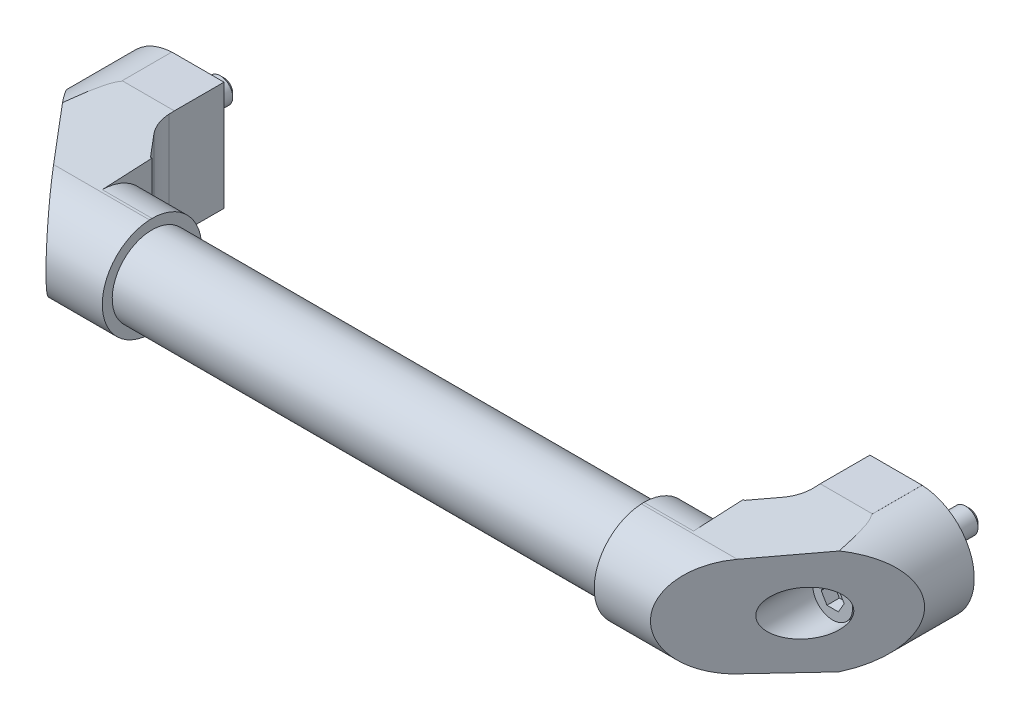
ISO-10303-21;
HEADER;
FILE_DESCRIPTION(('STEP AP214'),'2;1');
FILE_NAME('part.step','',(''),(''),'','','');
FILE_SCHEMA(('AUTOMOTIVE_DESIGN { 1 0 10303 214 1 1 1 1 }'));
ENDSEC;
DATA;
#1=APPLICATION_CONTEXT('core data for automotive mechanical design processes');
#2=APPLICATION_PROTOCOL_DEFINITION('international standard','automotive_design',2000,#1);
#3=PRODUCT_CONTEXT('',#1,'mechanical');
#4=PRODUCT('Part','Part','',(#3));
#5=PRODUCT_RELATED_PRODUCT_CATEGORY('part','',(#4));
#6=PRODUCT_DEFINITION_FORMATION('','',#4);
#7=PRODUCT_DEFINITION_CONTEXT('part definition',#1,'design');
#8=PRODUCT_DEFINITION('design','',#6,#7);
#9=PRODUCT_DEFINITION_SHAPE('','',#8);
#10=(LENGTH_UNIT() NAMED_UNIT(*) SI_UNIT(.MILLI.,.METRE.));
#11=(NAMED_UNIT(*) PLANE_ANGLE_UNIT() SI_UNIT($,.RADIAN.));
#12=(NAMED_UNIT(*) SI_UNIT($,.STERADIAN.) SOLID_ANGLE_UNIT());
#13=UNCERTAINTY_MEASURE_WITH_UNIT(LENGTH_MEASURE(1.E-05),#10,'distance_accuracy_value','');
#14=(GEOMETRIC_REPRESENTATION_CONTEXT(3) GLOBAL_UNCERTAINTY_ASSIGNED_CONTEXT((#13)) GLOBAL_UNIT_ASSIGNED_CONTEXT((#10,
#11,#12)) REPRESENTATION_CONTEXT('',''));
#15=CARTESIAN_POINT('',(0.,0.,0.));
#16=DIRECTION('',(0.,0.,1.));
#17=DIRECTION('',(1.,0.,0.));
#18=AXIS2_PLACEMENT_3D('',#15,#16,#17);
#19=CARTESIAN_POINT('',(0.,0.,25.));
#20=DIRECTION('',(0.,0.,1.));
#21=DIRECTION('',(1.,0.,0.));
#22=AXIS2_PLACEMENT_3D('',#19,#20,#21);
#23=PLANE('',#22);
#24=CARTESIAN_POINT('',(0.,0.,25.));
#25=DIRECTION('',(0.,0.,1.));
#26=DIRECTION('',(1.,0.,0.));
#27=AXIS2_PLACEMENT_3D('',#24,#25,#26);
#28=CIRCLE('',#27,9.);
#29=CARTESIAN_POINT('',(9.,0.,25.));
#30=VERTEX_POINT('',#29);
#31=EDGE_CURVE('E423',#30,#30,#28,.T.);
#32=ORIENTED_EDGE('',*,*,#31,.T.);
#33=EDGE_LOOP('',(#32));
#34=FACE_BOUND('',#33,.T.);
#35=CARTESIAN_POINT('',(0.,0.,25.));
#36=DIRECTION('',(0.,0.,1.));
#37=DIRECTION('',(1.,0.,0.));
#38=AXIS2_PLACEMENT_3D('',#35,#36,#37);
#39=CIRCLE('',#38,8.);
#40=CARTESIAN_POINT('',(8.,0.,25.));
#41=VERTEX_POINT('',#40);
#42=EDGE_CURVE('E404',#41,#41,#39,.T.);
#43=ORIENTED_EDGE('',*,*,#42,.F.);
#44=EDGE_LOOP('',(#43));
#45=FACE_BOUND('',#44,.T.);
#46=ADVANCED_FACE('F14',(#34,#45),#23,.T.);
#47=CARTESIAN_POINT('',(300.,0.,25.));
#48=DIRECTION('',(0.,0.,1.));
#49=DIRECTION('',(1.,0.,0.));
#50=AXIS2_PLACEMENT_3D('',#47,#48,#49);
#51=PLANE('',#50);
#52=CARTESIAN_POINT('',(300.,0.,25.));
#53=DIRECTION('',(0.,0.,1.));
#54=DIRECTION('',(1.,0.,0.));
#55=AXIS2_PLACEMENT_3D('',#52,#53,#54);
#56=CIRCLE('',#55,9.);
#57=CARTESIAN_POINT('',(309.,0.,25.));
#58=VERTEX_POINT('',#57);
#59=EDGE_CURVE('E428',#58,#58,#56,.T.);
#60=ORIENTED_EDGE('',*,*,#59,.T.);
#61=EDGE_LOOP('',(#60));
#62=FACE_BOUND('',#61,.T.);
#63=CARTESIAN_POINT('',(300.,0.,25.));
#64=DIRECTION('',(0.,0.,1.));
#65=DIRECTION('',(1.,0.,0.));
#66=AXIS2_PLACEMENT_3D('',#63,#64,#65);
#67=CIRCLE('',#66,8.);
#68=CARTESIAN_POINT('',(308.,0.,25.));
#69=VERTEX_POINT('',#68);
#70=EDGE_CURVE('E417',#69,#69,#67,.T.);
#71=ORIENTED_EDGE('',*,*,#70,.F.);
#72=EDGE_LOOP('',(#71));
#73=FACE_BOUND('',#72,.T.);
#74=ADVANCED_FACE('F808',(#62,#73),#51,.T.);
#75=CARTESIAN_POINT('',(-22.,19.9756503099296,60.9866076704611));
#76=DIRECTION('',(0.,-0.998782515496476,-0.0493303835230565));
#77=DIRECTION('',(0.,-0.0493303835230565,0.998782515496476));
#78=AXIS2_PLACEMENT_3D('',#75,#76,#77);
#79=PLANE('',#78);
#80=CARTESIAN_POINT('',(0.,0.,465.429647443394));
#81=DIRECTION('',(0.,-0.998782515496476,-0.0493303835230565));
#82=DIRECTION('',(0.,0.0493303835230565,-0.998782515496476));
#83=AXIS2_PLACEMENT_3D('',#80,#81,#82);
#84=ELLIPSE('',#83,445.972612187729,22.);
#85=CARTESIAN_POINT('',(-6.30778054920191,21.0763351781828,38.7012589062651));
#86=VERTEX_POINT('',#85);
#87=CARTESIAN_POINT('',(-0.9989685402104,21.9773078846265,20.4594427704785));
#88=VERTEX_POINT('',#87);
#89=EDGE_CURVE('E590',#86,#88,#84,.T.);
#90=ORIENTED_EDGE('',*,*,#89,.F.);
#91=DIRECTION('',(0.642328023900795,-0.0378082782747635,0.765496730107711));
#92=VECTOR('',#91,1.);
#93=CARTESIAN_POINT('',(-1.79772295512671,20.8108672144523,44.076136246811));
#94=LINE('',#93,#92);
#95=CARTESIAN_POINT('',(12.3918473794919,19.9756503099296,60.9866076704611));
#96=VERTEX_POINT('',#95);
#97=EDGE_CURVE('E670',#86,#96,#94,.T.);
#98=ORIENTED_EDGE('',*,*,#97,.T.);
#99=DIRECTION('',(1.,0.,0.));
#100=VECTOR('',#99,1.);
#101=CARTESIAN_POINT('',(-22.,19.9756503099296,60.9866076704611));
#102=LINE('',#101,#100);
#103=CARTESIAN_POINT('',(51.,19.9756503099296,60.9866076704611));
#104=VERTEX_POINT('',#103);
#105=EDGE_CURVE('E692',#96,#104,#102,.T.);
#106=ORIENTED_EDGE('',*,*,#105,.T.);
#107=DIRECTION('',(0.,0.0493303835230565,-0.998782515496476));
#108=VECTOR('',#107,1.);
#109=CARTESIAN_POINT('',(51.,19.9756503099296,60.9866076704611));
#110=LINE('',#109,#108);
#111=CARTESIAN_POINT('',(51.,20.0243793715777,60.));
#112=VERTEX_POINT('',#111);
#113=EDGE_CURVE('E676',#104,#112,#110,.T.);
#114=ORIENTED_EDGE('',*,*,#113,.T.);
#115=DIRECTION('',(1.,0.,0.));
#116=VECTOR('',#115,1.);
#117=CARTESIAN_POINT('',(-22.,20.0243793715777,60.));
#118=LINE('',#117,#116);
#119=CARTESIAN_POINT('',(31.,20.0243793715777,60.));
#120=VERTEX_POINT('',#119);
#121=EDGE_CURVE('E626',#120,#112,#118,.T.);
#122=ORIENTED_EDGE('',*,*,#121,.F.);
#123=DIRECTION('',(0.,-0.0493303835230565,0.998782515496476));
#124=VECTOR('',#123,1.);
#125=CARTESIAN_POINT('',(31.,19.9756503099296,60.9866076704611));
#126=LINE('',#125,#124);
#127=CARTESIAN_POINT('',(31.,21.0121896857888,40.));
#128=VERTEX_POINT('',#127);
#129=EDGE_CURVE('E621',#128,#120,#126,.T.);
#130=ORIENTED_EDGE('',*,*,#129,.F.);
#131=DIRECTION('',(1.,0.,0.));
#132=VECTOR('',#131,1.);
#133=CARTESIAN_POINT('',(-22.,21.0121896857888,40.));
#134=LINE('',#133,#132);
#135=CARTESIAN_POINT('',(30.4187874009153,21.0121896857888,40.));
#136=VERTEX_POINT('',#135);
#137=EDGE_CURVE('E652',#136,#128,#134,.T.);
#138=ORIENTED_EDGE('',*,*,#137,.F.);
#139=DIRECTION('',(-0.642328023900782,0.0378082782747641,-0.765496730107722));
#140=VECTOR('',#139,1.);
#141=CARTESIAN_POINT('',(19.1358545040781,21.6763180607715,26.5535241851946));
#142=LINE('',#141,#140);
#143=CARTESIAN_POINT('',(23.4898534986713,21.4200359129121,31.7424181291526));
#144=VERTEX_POINT('',#143);
#145=EDGE_CURVE('E662',#136,#144,#142,.T.);
#146=ORIENTED_EDGE('',*,*,#145,.T.);
#147=CARTESIAN_POINT('',(34.9999819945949,21.8951021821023,22.1238453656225));
#148=DIRECTION('',(0.,-0.998782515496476,-0.0493303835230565));
#149=DIRECTION('',(0.,0.0493303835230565,-0.998782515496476));
#150=AXIS2_PLACEMENT_3D('',#147,#148,#149);
#151=ELLIPSE('',#150,15.0182845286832,15.);
#152=CARTESIAN_POINT('',(20.,21.8962500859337,22.1006039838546));
#153=VERTEX_POINT('',#152);
#154=EDGE_CURVE('E660',#153,#144,#151,.F.);
#155=ORIENTED_EDGE('',*,*,#154,.F.);
#156=DIRECTION('',(0.,-0.0493303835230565,0.998782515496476));
#157=VECTOR('',#156,1.);
#158=CARTESIAN_POINT('',(20.,19.9756503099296,60.9866076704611));
#159=LINE('',#158,#157);
#160=CARTESIAN_POINT('',(20.,22.,20.));
#161=VERTEX_POINT('',#160);
#162=EDGE_CURVE('E658',#161,#153,#159,.T.);
#163=ORIENTED_EDGE('',*,*,#162,.F.);
#164=DIRECTION('',(1.,0.,0.));
#165=VECTOR('',#164,1.);
#166=CARTESIAN_POINT('',(-22.,22.,20.));
#167=LINE('',#166,#165);
#168=CARTESIAN_POINT('',(-0.9989685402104,22.,20.));
#169=VERTEX_POINT('',#168);
#170=EDGE_CURVE('E690',#169,#161,#167,.T.);
#171=ORIENTED_EDGE('',*,*,#170,.F.);
#172=DIRECTION('',(0.,0.0493303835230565,-0.998782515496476));
#173=VECTOR('',#172,1.);
#174=CARTESIAN_POINT('',(-0.998968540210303,19.9756503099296,60.9866076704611));
#175=LINE('',#174,#173);
#176=EDGE_CURVE('E595',#88,#169,#175,.T.);
#177=ORIENTED_EDGE('',*,*,#176,.F.);
#178=EDGE_LOOP('',(#90,#98,#106,#114,#122,#130,#138,#146,#155,#163,#171,#177));
#179=FACE_BOUND('',#178,.T.);
#180=ADVANCED_FACE('F16',(#179),#79,.F.);
#181=CARTESIAN_POINT('',(-22.,22.,0.));
#182=DIRECTION('',(0.,0.,1.));
#183=DIRECTION('',(-1.,0.,0.));
#184=AXIS2_PLACEMENT_3D('',#181,#182,#183);
#185=PLANE('',#184);
#186=CARTESIAN_POINT('',(0.,0.,0.));
#187=DIRECTION('',(0.,0.,1.));
#188=DIRECTION('',(-1.,0.,0.));
#189=AXIS2_PLACEMENT_3D('',#186,#187,#188);
#190=CIRCLE('',#189,4.99999999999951);
#191=CARTESIAN_POINT('',(-4.99999999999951,0.,0.));
#192=VERTEX_POINT('',#191);
#193=EDGE_CURVE('E704',#192,#192,#190,.F.);
#194=ORIENTED_EDGE('',*,*,#193,.F.);
#195=EDGE_LOOP('',(#194));
#196=FACE_BOUND('',#195,.T.);
#197=DIRECTION('',(1.,0.,0.));
#198=VECTOR('',#197,1.);
#199=CARTESIAN_POINT('',(-22.,-22.,0.));
#200=LINE('',#199,#198);
#201=CARTESIAN_POINT('',(-0.998968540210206,-22.,0.));
#202=VERTEX_POINT('',#201);
#203=CARTESIAN_POINT('',(20.,-22.,0.));
#204=VERTEX_POINT('',#203);
#205=EDGE_CURVE('E686',#202,#204,#200,.T.);
#206=ORIENTED_EDGE('',*,*,#205,.F.);
#207=DIRECTION('',(0.,-1.,0.));
#208=VECTOR('',#207,1.);
#209=CARTESIAN_POINT('',(-0.998968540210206,-21.9773078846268,0.));
#210=LINE('',#209,#208);
#211=CARTESIAN_POINT('',(-0.998968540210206,-21.9773078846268,0.));
#212=VERTEX_POINT('',#211);
#213=EDGE_CURVE('E576',#212,#202,#210,.T.);
#214=ORIENTED_EDGE('',*,*,#213,.F.);
#215=CARTESIAN_POINT('',(0.,0.,0.));
#216=DIRECTION('',(0.,0.,-1.));
#217=DIRECTION('',(1.,0.,0.));
#218=AXIS2_PLACEMENT_3D('',#215,#216,#217);
#219=CIRCLE('',#218,22.);
#220=CARTESIAN_POINT('',(-0.9989685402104,21.9773078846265,0.));
#221=VERTEX_POINT('',#220);
#222=EDGE_CURVE('E578',#212,#221,#219,.T.);
#223=ORIENTED_EDGE('',*,*,#222,.T.);
#224=DIRECTION('',(0.,1.,0.));
#225=VECTOR('',#224,1.);
#226=CARTESIAN_POINT('',(-0.9989685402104,21.9773078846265,0.));
#227=LINE('',#226,#225);
#228=CARTESIAN_POINT('',(-0.9989685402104,22.,0.));
#229=VERTEX_POINT('',#228);
#230=EDGE_CURVE('E580',#221,#229,#227,.T.);
#231=ORIENTED_EDGE('',*,*,#230,.T.);
#232=DIRECTION('',(1.,0.,0.));
#233=VECTOR('',#232,1.);
#234=CARTESIAN_POINT('',(-22.,22.,0.));
#235=LINE('',#234,#233);
#236=CARTESIAN_POINT('',(20.,22.,0.));
#237=VERTEX_POINT('',#236);
#238=EDGE_CURVE('E688',#229,#237,#235,.T.);
#239=ORIENTED_EDGE('',*,*,#238,.T.);
#240=DIRECTION('',(0.,1.,0.));
#241=VECTOR('',#240,1.);
#242=CARTESIAN_POINT('',(20.,-22.,0.));
#243=LINE('',#242,#241);
#244=EDGE_CURVE('E638',#204,#237,#243,.T.);
#245=ORIENTED_EDGE('',*,*,#244,.F.);
#246=EDGE_LOOP('',(#206,#214,#223,#231,#239,#245));
#247=FACE_BOUND('',#246,.T.);
#248=ADVANCED_FACE('F732',(#196,#247),#185,.F.);
#249=CARTESIAN_POINT('',(-22.,22.,0.));
#250=DIRECTION('',(0.,1.,0.));
#251=DIRECTION('',(-1.,0.,0.));
#252=AXIS2_PLACEMENT_3D('',#249,#250,#251);
#253=PLANE('',#252);
#254=ORIENTED_EDGE('',*,*,#238,.F.);
#255=DIRECTION('',(0.,0.,1.));
#256=VECTOR('',#255,1.);
#257=CARTESIAN_POINT('',(-0.9989685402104,22.,0.));
#258=LINE('',#257,#256);
#259=EDGE_CURVE('E9',#229,#169,#258,.T.);
#260=ORIENTED_EDGE('',*,*,#259,.T.);
#261=ORIENTED_EDGE('',*,*,#170,.T.);
#262=DIRECTION('',(0.,0.,-1.));
#263=VECTOR('',#262,1.);
#264=CARTESIAN_POINT('',(20.,22.,0.));
#265=LINE('',#264,#263);
#266=EDGE_CURVE('E655',#161,#237,#265,.T.);
#267=ORIENTED_EDGE('',*,*,#266,.T.);
#268=EDGE_LOOP('',(#254,#260,#261,#267));
#269=FACE_BOUND('',#268,.T.);
#270=ADVANCED_FACE('F737',(#269),#253,.T.);
#271=CARTESIAN_POINT('',(-22.,22.,20.));
#272=DIRECTION('',(0.766044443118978,0.,-0.64278760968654));
#273=DIRECTION('',(0.64278760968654,0.,0.766044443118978));
#274=AXIS2_PLACEMENT_3D('',#271,#272,#273);
#275=PLANE('',#274);
#276=CARTESIAN_POINT('',(0.,0.,46.2185790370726));
#277=DIRECTION('',(0.766044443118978,0.,-0.64278760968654));
#278=DIRECTION('',(0.64278760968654,0.,0.766044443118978));
#279=AXIS2_PLACEMENT_3D('',#276,#277,#278);
#280=ELLIPSE('',#279,14.0015144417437,9.);
#281=CARTESIAN_POINT('',(9.,0.,56.9443613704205));
#282=VERTEX_POINT('',#281);
#283=EDGE_CURVE('E628',#282,#282,#280,.T.);
#284=ORIENTED_EDGE('',*,*,#283,.T.);
#285=EDGE_LOOP('',(#284));
#286=FACE_BOUND('',#285,.T.);
#287=ORIENTED_EDGE('',*,*,#97,.F.);
#288=CARTESIAN_POINT('',(0.,0.,46.2185790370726));
#289=DIRECTION('',(0.766044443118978,0.,-0.64278760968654));
#290=DIRECTION('',(-0.64278760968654,0.,-0.766044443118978));
#291=AXIS2_PLACEMENT_3D('',#288,#289,#290);
#292=ELLIPSE('',#291,34.225924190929,22.);
#293=CARTESIAN_POINT('',(-6.30778054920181,-21.076335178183,38.7012589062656));
#294=VERTEX_POINT('',#293);
#295=EDGE_CURVE('E713',#294,#86,#292,.T.);
#296=ORIENTED_EDGE('',*,*,#295,.F.);
#297=DIRECTION('',(-0.642328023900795,-0.0378082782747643,-0.765496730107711));
#298=VECTOR('',#297,1.);
#299=CARTESIAN_POINT('',(-22.,-22.,20.));
#300=LINE('',#299,#298);
#301=CARTESIAN_POINT('',(12.3918473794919,-19.9756503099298,60.9866076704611));
#302=VERTEX_POINT('',#301);
#303=EDGE_CURVE('E665',#302,#294,#300,.T.);
#304=ORIENTED_EDGE('',*,*,#303,.F.);
#305=CARTESIAN_POINT('',(11.5639852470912,0.,60.));
#306=DIRECTION('',(0.766044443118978,0.,-0.64278760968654));
#307=DIRECTION('',(0.64278760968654,0.,0.766044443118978));
#308=AXIS2_PLACEMENT_3D('',#305,#306,#307);
#309=ELLIPSE('',#308,26.1081457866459,20.);
#310=EDGE_CURVE('E668',#96,#302,#309,.T.);
#311=ORIENTED_EDGE('',*,*,#310,.F.);
#312=EDGE_LOOP('',(#287,#296,#304,#311));
#313=FACE_BOUND('',#312,.T.);
#314=ADVANCED_FACE('F787',(#286,#313),#275,.F.);
#315=CARTESIAN_POINT('',(51.,0.,60.));
#316=DIRECTION('',(-1.,0.,0.));
#317=DIRECTION('',(0.,-1.,0.));
#318=AXIS2_PLACEMENT_3D('',#315,#316,#317);
#319=PLANE('',#318);
#320=CARTESIAN_POINT('',(51.,0.,60.));
#321=DIRECTION('',(-1.,0.,0.));
#322=DIRECTION('',(0.,-1.,0.));
#323=AXIS2_PLACEMENT_3D('',#320,#321,#322);
#324=CIRCLE('',#323,16.);
#325=CARTESIAN_POINT('',(51.,-16.,60.));
#326=VERTEX_POINT('',#325);
#327=EDGE_CURVE('E672',#326,#326,#324,.T.);
#328=ORIENTED_EDGE('',*,*,#327,.T.);
#329=EDGE_LOOP('',(#328));
#330=FACE_BOUND('',#329,.T.);
#331=DIRECTION('',(0.,1.,0.));
#332=VECTOR('',#331,1.);
#333=CARTESIAN_POINT('',(51.,20.,60.));
#334=LINE('',#333,#332);
#335=CARTESIAN_POINT('',(51.,20.,60.));
#336=VERTEX_POINT('',#335);
#337=EDGE_CURVE('E599',#336,#112,#334,.T.);
#338=ORIENTED_EDGE('',*,*,#337,.T.);
#339=ORIENTED_EDGE('',*,*,#113,.F.);
#340=CARTESIAN_POINT('',(51.,0.,60.));
#341=DIRECTION('',(-1.,0.,0.));
#342=DIRECTION('',(0.,-1.,0.));
#343=AXIS2_PLACEMENT_3D('',#340,#341,#342);
#344=CIRCLE('',#343,20.);
#345=CARTESIAN_POINT('',(51.,-19.9756503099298,60.9866076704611));
#346=VERTEX_POINT('',#345);
#347=EDGE_CURVE('E673',#346,#104,#344,.T.);
#348=ORIENTED_EDGE('',*,*,#347,.F.);
#349=DIRECTION('',(0.,0.0493303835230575,0.998782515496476));
#350=VECTOR('',#349,1.);
#351=CARTESIAN_POINT('',(51.,-22.,20.));
#352=LINE('',#351,#350);
#353=CARTESIAN_POINT('',(51.,-20.0243793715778,60.));
#354=VERTEX_POINT('',#353);
#355=EDGE_CURVE('E679',#354,#346,#352,.T.);
#356=ORIENTED_EDGE('',*,*,#355,.F.);
#357=DIRECTION('',(0.,-1.,0.));
#358=VECTOR('',#357,1.);
#359=CARTESIAN_POINT('',(51.,-20.,60.));
#360=LINE('',#359,#358);
#361=CARTESIAN_POINT('',(51.,-20.,60.));
#362=VERTEX_POINT('',#361);
#363=EDGE_CURVE('E602',#362,#354,#360,.T.);
#364=ORIENTED_EDGE('',*,*,#363,.F.);
#365=CARTESIAN_POINT('',(51.,0.,60.));
#366=DIRECTION('',(1.,0.,0.));
#367=DIRECTION('',(0.,1.,0.));
#368=AXIS2_PLACEMENT_3D('',#365,#366,#367);
#369=CIRCLE('',#368,20.);
#370=EDGE_CURVE('E597',#362,#336,#369,.T.);
#371=ORIENTED_EDGE('',*,*,#370,.T.);
#372=EDGE_LOOP('',(#338,#339,#348,#356,#364,#371));
#373=FACE_BOUND('',#372,.T.);
#374=ADVANCED_FACE('F777',(#330,#373),#319,.F.);
#375=CARTESIAN_POINT('',(51.,-22.,40.));
#376=DIRECTION('',(0.,0.,-1.));
#377=DIRECTION('',(1.,0.,0.));
#378=AXIS2_PLACEMENT_3D('',#375,#376,#377);
#379=PLANE('',#378);
#380=ORIENTED_EDGE('',*,*,#137,.T.);
#381=DIRECTION('',(0.,-1.,0.));
#382=VECTOR('',#381,1.);
#383=CARTESIAN_POINT('',(31.,-22.,40.));
#384=LINE('',#383,#382);
#385=CARTESIAN_POINT('',(31.,0.,40.));
#386=VERTEX_POINT('',#385);
#387=EDGE_CURVE('E712',#128,#386,#384,.T.);
#388=ORIENTED_EDGE('',*,*,#387,.T.);
#389=CARTESIAN_POINT('',(31.,-21.012189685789,40.));
#390=VERTEX_POINT('',#389);
#391=EDGE_CURVE('E707',#386,#390,#384,.T.);
#392=ORIENTED_EDGE('',*,*,#391,.T.);
#393=DIRECTION('',(-1.,0.,0.));
#394=VECTOR('',#393,1.);
#395=CARTESIAN_POINT('',(-22.,-21.012189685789,40.));
#396=LINE('',#395,#394);
#397=CARTESIAN_POINT('',(30.4187874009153,-21.012189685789,40.));
#398=VERTEX_POINT('',#397);
#399=EDGE_CURVE('E650',#390,#398,#396,.T.);
#400=ORIENTED_EDGE('',*,*,#399,.T.);
#401=DIRECTION('',(0.,1.,0.));
#402=VECTOR('',#401,1.);
#403=CARTESIAN_POINT('',(30.4187874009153,-22.,40.));
#404=LINE('',#403,#402);
#405=EDGE_CURVE('E647',#398,#136,#404,.T.);
#406=ORIENTED_EDGE('',*,*,#405,.T.);
#407=EDGE_LOOP('',(#380,#388,#392,#400,#406));
#408=FACE_BOUND('',#407,.T.);
#409=ADVANCED_FACE('F755',(#408),#379,.T.);
#410=CARTESIAN_POINT('',(-22.,-22.,0.));
#411=DIRECTION('',(0.,1.,0.));
#412=DIRECTION('',(-1.,0.,0.));
#413=AXIS2_PLACEMENT_3D('',#410,#411,#412);
#414=PLANE('',#413);
#415=DIRECTION('',(1.,0.,0.));
#416=VECTOR('',#415,1.);
#417=CARTESIAN_POINT('',(-22.,-22.,20.));
#418=LINE('',#417,#416);
#419=CARTESIAN_POINT('',(-0.998968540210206,-22.,20.));
#420=VERTEX_POINT('',#419);
#421=CARTESIAN_POINT('',(20.,-22.,20.));
#422=VERTEX_POINT('',#421);
#423=EDGE_CURVE('E684',#420,#422,#418,.T.);
#424=ORIENTED_EDGE('',*,*,#423,.F.);
#425=DIRECTION('',(0.,0.,-1.));
#426=VECTOR('',#425,1.);
#427=CARTESIAN_POINT('',(-0.998968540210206,-22.,0.));
#428=LINE('',#427,#426);
#429=EDGE_CURVE('E592',#420,#202,#428,.T.);
#430=ORIENTED_EDGE('',*,*,#429,.T.);
#431=ORIENTED_EDGE('',*,*,#205,.T.);
#432=DIRECTION('',(0.,0.,-1.));
#433=VECTOR('',#432,1.);
#434=CARTESIAN_POINT('',(20.,-22.,22.1006039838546));
#435=LINE('',#434,#433);
#436=EDGE_CURVE('E635',#422,#204,#435,.T.);
#437=ORIENTED_EDGE('',*,*,#436,.F.);
#438=EDGE_LOOP('',(#424,#430,#431,#437));
#439=FACE_BOUND('',#438,.T.);
#440=ADVANCED_FACE('F724',(#439),#414,.F.);
#441=CARTESIAN_POINT('',(-22.,-22.,20.));
#442=DIRECTION('',(0.,0.998782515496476,-0.0493303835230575));
#443=DIRECTION('',(0.,-0.0493303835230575,-0.998782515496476));
#444=AXIS2_PLACEMENT_3D('',#441,#442,#443);
#445=PLANE('',#444);
#446=CARTESIAN_POINT('',(0.,0.,465.429647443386));
#447=DIRECTION('',(0.,0.998782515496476,-0.0493303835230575));
#448=DIRECTION('',(0.,-0.0493303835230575,-0.998782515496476));
#449=AXIS2_PLACEMENT_3D('',#446,#447,#448);
#450=ELLIPSE('',#449,445.97261218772,22.);
#451=CARTESIAN_POINT('',(-0.998968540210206,-21.9773078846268,20.4594427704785));
#452=VERTEX_POINT('',#451);
#453=EDGE_CURVE('E588',#452,#294,#450,.T.);
#454=ORIENTED_EDGE('',*,*,#453,.F.);
#455=DIRECTION('',(0.,-0.0493303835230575,-0.998782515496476));
#456=VECTOR('',#455,1.);
#457=CARTESIAN_POINT('',(-0.998968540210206,-22.,20.));
#458=LINE('',#457,#456);
#459=EDGE_CURVE('E22',#452,#420,#458,.T.);
#460=ORIENTED_EDGE('',*,*,#459,.T.);
#461=ORIENTED_EDGE('',*,*,#423,.T.);
#462=DIRECTION('',(0.,-0.0493303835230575,-0.998782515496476));
#463=VECTOR('',#462,1.);
#464=CARTESIAN_POINT('',(20.,-22.,20.));
#465=LINE('',#464,#463);
#466=CARTESIAN_POINT('',(20.,-21.8962500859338,22.1006039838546));
#467=VERTEX_POINT('',#466);
#468=EDGE_CURVE('E694',#467,#422,#465,.T.);
#469=ORIENTED_EDGE('',*,*,#468,.F.);
#470=CARTESIAN_POINT('',(34.9999819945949,-21.8951021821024,22.1238453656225));
#471=DIRECTION('',(0.,0.998782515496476,-0.0493303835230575));
#472=DIRECTION('',(0.,0.0493303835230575,0.998782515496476));
#473=AXIS2_PLACEMENT_3D('',#470,#471,#472);
#474=ELLIPSE('',#473,15.0182845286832,15.);
#475=CARTESIAN_POINT('',(23.4898534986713,-21.4200359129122,31.7424181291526));
#476=VERTEX_POINT('',#475);
#477=EDGE_CURVE('E699',#476,#467,#474,.F.);
#478=ORIENTED_EDGE('',*,*,#477,.F.);
#479=DIRECTION('',(0.642328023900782,0.0378082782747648,0.765496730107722));
#480=VECTOR('',#479,1.);
#481=CARTESIAN_POINT('',(-1.06642254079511,-22.8654508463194,2.47738793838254));
#482=LINE('',#481,#480);
#483=EDGE_CURVE('E701',#476,#398,#482,.T.);
#484=ORIENTED_EDGE('',*,*,#483,.T.);
#485=ORIENTED_EDGE('',*,*,#399,.F.);
#486=DIRECTION('',(0.,-0.0493303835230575,-0.998782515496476));
#487=VECTOR('',#486,1.);
#488=CARTESIAN_POINT('',(31.,-22.,20.));
#489=LINE('',#488,#487);
#490=CARTESIAN_POINT('',(31.,-20.0243793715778,60.));
#491=VERTEX_POINT('',#490);
#492=EDGE_CURVE('E619',#491,#390,#489,.T.);
#493=ORIENTED_EDGE('',*,*,#492,.F.);
#494=DIRECTION('',(1.,0.,0.));
#495=VECTOR('',#494,1.);
#496=CARTESIAN_POINT('',(-22.,-20.0243793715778,60.));
#497=LINE('',#496,#495);
#498=EDGE_CURVE('E623',#491,#354,#497,.T.);
#499=ORIENTED_EDGE('',*,*,#498,.T.);
#500=ORIENTED_EDGE('',*,*,#355,.T.);
#501=DIRECTION('',(1.,0.,0.));
#502=VECTOR('',#501,1.);
#503=CARTESIAN_POINT('',(-22.,-19.9756503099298,60.9866076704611));
#504=LINE('',#503,#502);
#505=EDGE_CURVE('E681',#302,#346,#504,.T.);
#506=ORIENTED_EDGE('',*,*,#505,.F.);
#507=ORIENTED_EDGE('',*,*,#303,.T.);
#508=EDGE_LOOP('',(#454,#460,#461,#469,#478,#484,#485,#493,#499,#500,#506,#507));
#509=FACE_BOUND('',#508,.T.);
#510=ADVANCED_FACE('F718',(#509),#445,.F.);
#511=CARTESIAN_POINT('',(-22.,0.,60.));
#512=DIRECTION('',(1.,0.,0.));
#513=DIRECTION('',(0.,1.,0.));
#514=AXIS2_PLACEMENT_3D('',#511,#512,#513);
#515=CYLINDRICAL_SURFACE('',#514,20.);
#516=ORIENTED_EDGE('',*,*,#310,.T.);
#517=ORIENTED_EDGE('',*,*,#505,.T.);
#518=ORIENTED_EDGE('',*,*,#347,.T.);
#519=ORIENTED_EDGE('',*,*,#105,.F.);
#520=EDGE_LOOP('',(#516,#517,#518,#519));
#521=FACE_BOUND('',#520,.T.);
#522=ADVANCED_FACE('F781',(#521),#515,.T.);
#523=CARTESIAN_POINT('',(8.8179323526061,0.,60.));
#524=DIRECTION('',(-1.,0.,0.));
#525=DIRECTION('',(0.,-1.,0.));
#526=AXIS2_PLACEMENT_3D('',#523,#524,#525);
#527=CYLINDRICAL_SURFACE('',#526,16.);
#528=ORIENTED_EDGE('',*,*,#327,.F.);
#529=EDGE_LOOP('',(#528));
#530=FACE_BOUND('',#529,.T.);
#531=CARTESIAN_POINT('',(249.,0.,60.));
#532=DIRECTION('',(-1.,0.,0.));
#533=DIRECTION('',(0.,-1.,0.));
#534=AXIS2_PLACEMENT_3D('',#531,#532,#533);
#535=CIRCLE('',#534,16.);
#536=CARTESIAN_POINT('',(249.,-16.,60.));
#537=VERTEX_POINT('',#536);
#538=EDGE_CURVE('E527',#537,#537,#535,.T.);
#539=ORIENTED_EDGE('',*,*,#538,.T.);
#540=EDGE_LOOP('',(#539));
#541=FACE_BOUND('',#540,.T.);
#542=ADVANCED_FACE('F1251',(#530,#541),#527,.T.);
#543=CARTESIAN_POINT('',(23.4898534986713,-22.,31.7424181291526));
#544=DIRECTION('',(-0.766044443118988,0.,0.642787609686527));
#545=DIRECTION('',(-0.642787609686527,0.,-0.766044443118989));
#546=AXIS2_PLACEMENT_3D('',#543,#544,#545);
#547=PLANE('',#546);
#548=ORIENTED_EDGE('',*,*,#405,.F.);
#549=ORIENTED_EDGE('',*,*,#483,.F.);
#550=DIRECTION('',(0.,1.,0.));
#551=VECTOR('',#550,1.);
#552=CARTESIAN_POINT('',(23.4898534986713,-22.,31.7424181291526));
#553=LINE('',#552,#551);
#554=EDGE_CURVE('E644',#476,#144,#553,.T.);
#555=ORIENTED_EDGE('',*,*,#554,.T.);
#556=ORIENTED_EDGE('',*,*,#145,.F.);
#557=EDGE_LOOP('',(#548,#549,#555,#556));
#558=FACE_BOUND('',#557,.T.);
#559=ADVANCED_FACE('F751',(#558),#547,.F.);
#560=CARTESIAN_POINT('',(34.9999819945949,-22.,22.1238453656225));
#561=DIRECTION('',(0.,1.,0.));
#562=DIRECTION('',(-1.,0.,0.));
#563=AXIS2_PLACEMENT_3D('',#560,#561,#562);
#564=CYLINDRICAL_SURFACE('',#563,15.);
#565=ORIENTED_EDGE('',*,*,#154,.T.);
#566=ORIENTED_EDGE('',*,*,#554,.F.);
#567=ORIENTED_EDGE('',*,*,#477,.T.);
#568=DIRECTION('',(0.,1.,0.));
#569=VECTOR('',#568,1.);
#570=CARTESIAN_POINT('',(20.,-22.,22.1006039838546));
#571=LINE('',#570,#569);
#572=EDGE_CURVE('E641',#467,#153,#571,.T.);
#573=ORIENTED_EDGE('',*,*,#572,.T.);
#574=EDGE_LOOP('',(#565,#566,#567,#573));
#575=FACE_BOUND('',#574,.T.);
#576=ADVANCED_FACE('F747',(#575),#564,.F.);
#577=CARTESIAN_POINT('',(20.,-22.,22.1006039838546));
#578=DIRECTION('',(1.,0.,0.));
#579=DIRECTION('',(0.,1.,0.));
#580=AXIS2_PLACEMENT_3D('',#577,#578,#579);
#581=PLANE('',#580);
#582=ORIENTED_EDGE('',*,*,#162,.T.);
#583=ORIENTED_EDGE('',*,*,#572,.F.);
#584=ORIENTED_EDGE('',*,*,#468,.T.);
#585=ORIENTED_EDGE('',*,*,#436,.T.);
#586=ORIENTED_EDGE('',*,*,#244,.T.);
#587=ORIENTED_EDGE('',*,*,#266,.F.);
#588=EDGE_LOOP('',(#582,#583,#584,#585,#586,#587));
#589=FACE_BOUND('',#588,.T.);
#590=ADVANCED_FACE('F728',(#589),#581,.T.);
#591=CARTESIAN_POINT('',(0.,0.,31.7424181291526));
#592=DIRECTION('',(0.,0.,1.));
#593=DIRECTION('',(0.,1.,0.));
#594=AXIS2_PLACEMENT_3D('',#591,#592,#593);
#595=CYLINDRICAL_SURFACE('',#594,4.99999999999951);
#596=CARTESIAN_POINT('',(0.,0.,-18.5));
#597=DIRECTION('',(0.,0.,1.));
#598=DIRECTION('',(0.,1.,0.));
#599=AXIS2_PLACEMENT_3D('',#596,#597,#598);
#600=CIRCLE('',#599,4.99999999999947);
#601=CARTESIAN_POINT('',(0.,4.99999999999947,-18.5));
#602=VERTEX_POINT('',#601);
#603=EDGE_CURVE('E629',#602,#602,#600,.T.);
#604=ORIENTED_EDGE('',*,*,#603,.T.);
#605=EDGE_LOOP('',(#604));
#606=FACE_BOUND('',#605,.T.);
#607=ORIENTED_EDGE('',*,*,#193,.T.);
#608=EDGE_LOOP('',(#607));
#609=FACE_BOUND('',#608,.T.);
#610=ADVANCED_FACE('F1204',(#606,#609),#595,.T.);
#611=CARTESIAN_POINT('',(0.,0.,-20.));
#612=DIRECTION('',(0.,0.,1.));
#613=DIRECTION('',(0.,1.,0.));
#614=AXIS2_PLACEMENT_3D('',#611,#612,#613);
#615=PLANE('',#614);
#616=CARTESIAN_POINT('',(0.,0.,-20.));
#617=DIRECTION('',(0.,0.,1.));
#618=DIRECTION('',(0.,1.,0.));
#619=AXIS2_PLACEMENT_3D('',#616,#617,#618);
#620=CIRCLE('',#619,3.49999999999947);
#621=CARTESIAN_POINT('',(0.,3.49999999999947,-20.));
#622=VERTEX_POINT('',#621);
#623=EDGE_CURVE('E632',#622,#622,#620,.T.);
#624=ORIENTED_EDGE('',*,*,#623,.F.);
#625=EDGE_LOOP('',(#624));
#626=FACE_BOUND('',#625,.T.);
#627=ADVANCED_FACE('F1209',(#626),#615,.F.);
#628=CARTESIAN_POINT('',(0.,0.,-20.));
#629=DIRECTION('',(0.,0.,1.));
#630=DIRECTION('',(0.,1.,0.));
#631=AXIS2_PLACEMENT_3D('',#628,#629,#630);
#632=CONICAL_SURFACE('',#631,3.49999999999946,0.785398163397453);
#633=ORIENTED_EDGE('',*,*,#603,.F.);
#634=EDGE_LOOP('',(#633));
#635=FACE_BOUND('',#634,.T.);
#636=ORIENTED_EDGE('',*,*,#623,.T.);
#637=EDGE_LOOP('',(#636));
#638=FACE_BOUND('',#637,.T.);
#639=ADVANCED_FACE('F1156',(#635,#638),#632,.T.);
#640=CARTESIAN_POINT('',(0.,0.,30.));
#641=DIRECTION('',(0.,0.,1.));
#642=DIRECTION('',(-1.,0.,0.));
#643=AXIS2_PLACEMENT_3D('',#640,#641,#642);
#644=CYLINDRICAL_SURFACE('',#643,9.);
#645=ORIENTED_EDGE('',*,*,#283,.F.);
#646=EDGE_LOOP('',(#645));
#647=FACE_BOUND('',#646,.T.);
#648=ORIENTED_EDGE('',*,*,#31,.F.);
#649=EDGE_LOOP('',(#648));
#650=FACE_BOUND('',#649,.T.);
#651=ADVANCED_FACE('F1150',(#647,#650),#644,.F.);
#652=CARTESIAN_POINT('',(31.,20.,60.));
#653=DIRECTION('',(0.,0.,-1.));
#654=DIRECTION('',(1.,0.,0.));
#655=AXIS2_PLACEMENT_3D('',#652,#653,#654);
#656=PLANE('',#655);
#657=ORIENTED_EDGE('',*,*,#121,.T.);
#658=ORIENTED_EDGE('',*,*,#337,.F.);
#659=DIRECTION('',(1.,0.,0.));
#660=VECTOR('',#659,1.);
#661=CARTESIAN_POINT('',(31.,20.,60.));
#662=LINE('',#661,#660);
#663=CARTESIAN_POINT('',(31.,20.,60.));
#664=VERTEX_POINT('',#663);
#665=EDGE_CURVE('E616',#664,#336,#662,.T.);
#666=ORIENTED_EDGE('',*,*,#665,.F.);
#667=DIRECTION('',(0.,1.,0.));
#668=VECTOR('',#667,1.);
#669=CARTESIAN_POINT('',(31.,20.,60.));
#670=LINE('',#669,#668);
#671=EDGE_CURVE('E608',#664,#120,#670,.T.);
#672=ORIENTED_EDGE('',*,*,#671,.T.);
#673=EDGE_LOOP('',(#657,#658,#666,#672));
#674=FACE_BOUND('',#673,.T.);
#675=ADVANCED_FACE('F1155',(#674),#656,.T.);
#676=CARTESIAN_POINT('',(31.,-20.,60.));
#677=DIRECTION('',(0.,0.,1.));
#678=DIRECTION('',(-1.,0.,0.));
#679=AXIS2_PLACEMENT_3D('',#676,#677,#678);
#680=PLANE('',#679);
#681=DIRECTION('',(0.,-1.,0.));
#682=VECTOR('',#681,1.);
#683=CARTESIAN_POINT('',(31.,-20.,60.));
#684=LINE('',#683,#682);
#685=CARTESIAN_POINT('',(31.,-20.,60.));
#686=VERTEX_POINT('',#685);
#687=EDGE_CURVE('E611',#686,#491,#684,.T.);
#688=ORIENTED_EDGE('',*,*,#687,.F.);
#689=DIRECTION('',(1.,0.,0.));
#690=VECTOR('',#689,1.);
#691=CARTESIAN_POINT('',(31.,-20.,60.));
#692=LINE('',#691,#690);
#693=EDGE_CURVE('E614',#686,#362,#692,.T.);
#694=ORIENTED_EDGE('',*,*,#693,.T.);
#695=ORIENTED_EDGE('',*,*,#363,.T.);
#696=ORIENTED_EDGE('',*,*,#498,.F.);
#697=EDGE_LOOP('',(#688,#694,#695,#696));
#698=FACE_BOUND('',#697,.T.);
#699=ADVANCED_FACE('F772',(#698),#680,.F.);
#700=CARTESIAN_POINT('',(31.,0.,60.));
#701=DIRECTION('',(1.,0.,0.));
#702=DIRECTION('',(0.,1.,0.));
#703=AXIS2_PLACEMENT_3D('',#700,#701,#702);
#704=CYLINDRICAL_SURFACE('',#703,20.);
#705=CARTESIAN_POINT('',(31.,0.,60.));
#706=DIRECTION('',(1.,0.,0.));
#707=DIRECTION('',(0.,1.,0.));
#708=AXIS2_PLACEMENT_3D('',#705,#706,#707);
#709=CIRCLE('',#708,20.);
#710=EDGE_CURVE('E605',#686,#386,#709,.T.);
#711=ORIENTED_EDGE('',*,*,#710,.T.);
#712=EDGE_CURVE('E604',#386,#664,#709,.T.);
#713=ORIENTED_EDGE('',*,*,#712,.T.);
#714=ORIENTED_EDGE('',*,*,#665,.T.);
#715=ORIENTED_EDGE('',*,*,#370,.F.);
#716=ORIENTED_EDGE('',*,*,#693,.F.);
#717=EDGE_LOOP('',(#711,#713,#714,#715,#716));
#718=FACE_BOUND('',#717,.T.);
#719=ADVANCED_FACE('F768',(#718),#704,.T.);
#720=CARTESIAN_POINT('',(31.,0.,60.));
#721=DIRECTION('',(1.,0.,0.));
#722=DIRECTION('',(0.,1.,0.));
#723=AXIS2_PLACEMENT_3D('',#720,#721,#722);
#724=PLANE('',#723);
#725=ORIENTED_EDGE('',*,*,#129,.T.);
#726=ORIENTED_EDGE('',*,*,#671,.F.);
#727=ORIENTED_EDGE('',*,*,#712,.F.);
#728=ORIENTED_EDGE('',*,*,#387,.F.);
#729=EDGE_LOOP('',(#725,#726,#727,#728));
#730=FACE_BOUND('',#729,.T.);
#731=ADVANCED_FACE('F764',(#730),#724,.T.);
#732=ORIENTED_EDGE('',*,*,#492,.T.);
#733=ORIENTED_EDGE('',*,*,#391,.F.);
#734=ORIENTED_EDGE('',*,*,#710,.F.);
#735=ORIENTED_EDGE('',*,*,#687,.T.);
#736=EDGE_LOOP('',(#732,#733,#734,#735));
#737=FACE_BOUND('',#736,.T.);
#738=ADVANCED_FACE('F760',(#737),#724,.T.);
#739=CARTESIAN_POINT('',(-0.9989685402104,21.9773078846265,80.));
#740=DIRECTION('',(-1.,0.,0.));
#741=DIRECTION('',(0.,-1.,0.));
#742=AXIS2_PLACEMENT_3D('',#739,#740,#741);
#743=PLANE('',#742);
#744=ORIENTED_EDGE('',*,*,#176,.T.);
#745=ORIENTED_EDGE('',*,*,#259,.F.);
#746=ORIENTED_EDGE('',*,*,#230,.F.);
#747=DIRECTION('',(0.,0.,-1.));
#748=VECTOR('',#747,1.);
#749=CARTESIAN_POINT('',(-0.9989685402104,21.9773078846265,80.));
#750=LINE('',#749,#748);
#751=EDGE_CURVE('E583',#88,#221,#750,.T.);
#752=ORIENTED_EDGE('',*,*,#751,.F.);
#753=EDGE_LOOP('',(#744,#745,#746,#752));
#754=FACE_BOUND('',#753,.T.);
#755=ADVANCED_FACE('F792',(#754),#743,.T.);
#756=CARTESIAN_POINT('',(-0.998968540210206,-21.9773078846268,80.));
#757=DIRECTION('',(1.,0.,0.));
#758=DIRECTION('',(0.,1.,0.));
#759=AXIS2_PLACEMENT_3D('',#756,#757,#758);
#760=PLANE('',#759);
#761=ORIENTED_EDGE('',*,*,#459,.F.);
#762=DIRECTION('',(0.,0.,-1.));
#763=VECTOR('',#762,1.);
#764=CARTESIAN_POINT('',(-0.998968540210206,-21.9773078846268,80.));
#765=LINE('',#764,#763);
#766=EDGE_CURVE('E586',#452,#212,#765,.T.);
#767=ORIENTED_EDGE('',*,*,#766,.T.);
#768=ORIENTED_EDGE('',*,*,#213,.T.);
#769=ORIENTED_EDGE('',*,*,#429,.F.);
#770=EDGE_LOOP('',(#761,#767,#768,#769));
#771=FACE_BOUND('',#770,.T.);
#772=ADVANCED_FACE('F794',(#771),#760,.F.);
#773=CARTESIAN_POINT('',(0.,0.,80.));
#774=DIRECTION('',(0.,0.,-1.));
#775=DIRECTION('',(1.,0.,0.));
#776=AXIS2_PLACEMENT_3D('',#773,#774,#775);
#777=CYLINDRICAL_SURFACE('',#776,22.);
#778=ORIENTED_EDGE('',*,*,#295,.T.);
#779=ORIENTED_EDGE('',*,*,#89,.T.);
#780=ORIENTED_EDGE('',*,*,#751,.T.);
#781=ORIENTED_EDGE('',*,*,#222,.F.);
#782=ORIENTED_EDGE('',*,*,#766,.F.);
#783=ORIENTED_EDGE('',*,*,#453,.T.);
#784=EDGE_LOOP('',(#778,#779,#780,#781,#782,#783));
#785=FACE_BOUND('',#784,.T.);
#786=ADVANCED_FACE('F789',(#785),#777,.T.);
#787=CARTESIAN_POINT('',(322.,19.9756503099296,60.9866076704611));
#788=DIRECTION('',(0.,-0.998782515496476,-0.0493303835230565));
#789=DIRECTION('',(0.,-0.0493303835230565,0.998782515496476));
#790=AXIS2_PLACEMENT_3D('',#787,#788,#789);
#791=PLANE('',#790);
#792=CARTESIAN_POINT('',(300.,0.,465.429647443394));
#793=DIRECTION('',(0.,0.998782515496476,0.0493303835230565));
#794=DIRECTION('',(0.,0.0493303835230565,-0.998782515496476));
#795=AXIS2_PLACEMENT_3D('',#792,#793,#794);
#796=ELLIPSE('',#795,445.972612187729,22.);
#797=CARTESIAN_POINT('',(306.307780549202,21.0763351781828,38.7012589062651));
#798=VERTEX_POINT('',#797);
#799=CARTESIAN_POINT('',(300.99896854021,21.9773078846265,20.4594427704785));
#800=VERTEX_POINT('',#799);
#801=EDGE_CURVE('E445',#798,#800,#796,.T.);
#802=ORIENTED_EDGE('',*,*,#801,.T.);
#803=DIRECTION('',(0.,0.0493303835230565,-0.998782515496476));
#804=VECTOR('',#803,1.);
#805=CARTESIAN_POINT('',(300.99896854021,19.9756503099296,60.9866076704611));
#806=LINE('',#805,#804);
#807=CARTESIAN_POINT('',(300.99896854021,22.,20.));
#808=VERTEX_POINT('',#807);
#809=EDGE_CURVE('E450',#800,#808,#806,.T.);
#810=ORIENTED_EDGE('',*,*,#809,.T.);
#811=DIRECTION('',(-1.,0.,0.));
#812=VECTOR('',#811,1.);
#813=CARTESIAN_POINT('',(322.,22.,20.));
#814=LINE('',#813,#812);
#815=CARTESIAN_POINT('',(280.,22.,20.));
#816=VERTEX_POINT('',#815);
#817=EDGE_CURVE('E545',#808,#816,#814,.T.);
#818=ORIENTED_EDGE('',*,*,#817,.T.);
#819=DIRECTION('',(0.,-0.0493303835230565,0.998782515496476));
#820=VECTOR('',#819,1.);
#821=CARTESIAN_POINT('',(280.,19.9756503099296,60.9866076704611));
#822=LINE('',#821,#820);
#823=CARTESIAN_POINT('',(280.,21.8962500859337,22.1006039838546));
#824=VERTEX_POINT('',#823);
#825=EDGE_CURVE('E513',#816,#824,#822,.T.);
#826=ORIENTED_EDGE('',*,*,#825,.T.);
#827=CARTESIAN_POINT('',(265.000018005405,21.8951021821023,22.1238453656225));
#828=DIRECTION('',(0.,0.998782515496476,0.0493303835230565));
#829=DIRECTION('',(0.,0.0493303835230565,-0.998782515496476));
#830=AXIS2_PLACEMENT_3D('',#827,#828,#829);
#831=ELLIPSE('',#830,15.0182845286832,15.);
#832=CARTESIAN_POINT('',(276.510146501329,21.4200359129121,31.7424181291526));
#833=VERTEX_POINT('',#832);
#834=EDGE_CURVE('E515',#824,#833,#831,.F.);
#835=ORIENTED_EDGE('',*,*,#834,.T.);
#836=DIRECTION('',(0.642328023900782,0.0378082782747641,-0.765496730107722));
#837=VECTOR('',#836,1.);
#838=CARTESIAN_POINT('',(280.864145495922,21.6763180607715,26.5535241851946));
#839=LINE('',#838,#837);
#840=CARTESIAN_POINT('',(269.581212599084,21.0121896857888,40.));
#841=VERTEX_POINT('',#840);
#842=EDGE_CURVE('E517',#841,#833,#839,.T.);
#843=ORIENTED_EDGE('',*,*,#842,.F.);
#844=DIRECTION('',(-1.,0.,0.));
#845=VECTOR('',#844,1.);
#846=CARTESIAN_POINT('',(322.,21.0121896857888,40.));
#847=LINE('',#846,#845);
#848=CARTESIAN_POINT('',(269.,21.0121896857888,40.));
#849=VERTEX_POINT('',#848);
#850=EDGE_CURVE('E507',#841,#849,#847,.T.);
#851=ORIENTED_EDGE('',*,*,#850,.T.);
#852=DIRECTION('',(0.,-0.0493303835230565,0.998782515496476));
#853=VECTOR('',#852,1.);
#854=CARTESIAN_POINT('',(269.,19.9756503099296,60.9866076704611));
#855=LINE('',#854,#853);
#856=CARTESIAN_POINT('',(269.,20.0243793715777,60.));
#857=VERTEX_POINT('',#856);
#858=EDGE_CURVE('E476',#849,#857,#855,.T.);
#859=ORIENTED_EDGE('',*,*,#858,.T.);
#860=DIRECTION('',(-1.,0.,0.));
#861=VECTOR('',#860,1.);
#862=CARTESIAN_POINT('',(322.,20.0243793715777,60.));
#863=LINE('',#862,#861);
#864=CARTESIAN_POINT('',(249.,20.0243793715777,60.));
#865=VERTEX_POINT('',#864);
#866=EDGE_CURVE('E481',#857,#865,#863,.T.);
#867=ORIENTED_EDGE('',*,*,#866,.T.);
#868=DIRECTION('',(0.,0.0493303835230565,-0.998782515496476));
#869=VECTOR('',#868,1.);
#870=CARTESIAN_POINT('',(249.,19.9756503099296,60.9866076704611));
#871=LINE('',#870,#869);
#872=CARTESIAN_POINT('',(249.,19.9756503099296,60.9866076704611));
#873=VERTEX_POINT('',#872);
#874=EDGE_CURVE('E531',#873,#865,#871,.T.);
#875=ORIENTED_EDGE('',*,*,#874,.F.);
#876=DIRECTION('',(-1.,0.,0.));
#877=VECTOR('',#876,1.);
#878=CARTESIAN_POINT('',(322.,19.9756503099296,60.9866076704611));
#879=LINE('',#878,#877);
#880=CARTESIAN_POINT('',(287.608152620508,19.9756503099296,60.9866076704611));
#881=VERTEX_POINT('',#880);
#882=EDGE_CURVE('E547',#881,#873,#879,.T.);
#883=ORIENTED_EDGE('',*,*,#882,.F.);
#884=DIRECTION('',(-0.642328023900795,-0.0378082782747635,0.765496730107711));
#885=VECTOR('',#884,1.);
#886=CARTESIAN_POINT('',(301.797722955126,20.8108672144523,44.076136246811));
#887=LINE('',#886,#885);
#888=EDGE_CURVE('E525',#798,#881,#887,.T.);
#889=ORIENTED_EDGE('',*,*,#888,.F.);
#890=EDGE_LOOP('',(#802,#810,#818,#826,#835,#843,#851,#859,#867,#875,#883,#889));
#891=FACE_BOUND('',#890,.T.);
#892=ADVANCED_FACE('F803',(#891),#791,.F.);
#893=CARTESIAN_POINT('',(322.,22.,0.));
#894=DIRECTION('',(0.,0.,1.));
#895=DIRECTION('',(1.,0.,0.));
#896=AXIS2_PLACEMENT_3D('',#893,#894,#895);
#897=PLANE('',#896);
#898=CARTESIAN_POINT('',(300.,0.,0.));
#899=DIRECTION('',(0.,0.,-1.));
#900=DIRECTION('',(1.,0.,0.));
#901=AXIS2_PLACEMENT_3D('',#898,#899,#900);
#902=CIRCLE('',#901,4.99999999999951);
#903=CARTESIAN_POINT('',(304.999999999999,0.,0.));
#904=VERTEX_POINT('',#903);
#905=EDGE_CURVE('E559',#904,#904,#902,.F.);
#906=ORIENTED_EDGE('',*,*,#905,.T.);
#907=EDGE_LOOP('',(#906));
#908=FACE_BOUND('',#907,.T.);
#909=DIRECTION('',(-1.,0.,0.));
#910=VECTOR('',#909,1.);
#911=CARTESIAN_POINT('',(322.,-22.,0.));
#912=LINE('',#911,#910);
#913=CARTESIAN_POINT('',(300.99896854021,-22.,0.));
#914=VERTEX_POINT('',#913);
#915=CARTESIAN_POINT('',(280.,-22.,0.));
#916=VERTEX_POINT('',#915);
#917=EDGE_CURVE('E541',#914,#916,#912,.T.);
#918=ORIENTED_EDGE('',*,*,#917,.T.);
#919=DIRECTION('',(0.,1.,0.));
#920=VECTOR('',#919,1.);
#921=CARTESIAN_POINT('',(280.,-22.,0.));
#922=LINE('',#921,#920);
#923=CARTESIAN_POINT('',(280.,22.,0.));
#924=VERTEX_POINT('',#923);
#925=EDGE_CURVE('E493',#916,#924,#922,.T.);
#926=ORIENTED_EDGE('',*,*,#925,.T.);
#927=DIRECTION('',(-1.,0.,0.));
#928=VECTOR('',#927,1.);
#929=CARTESIAN_POINT('',(322.,22.,0.));
#930=LINE('',#929,#928);
#931=CARTESIAN_POINT('',(300.99896854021,22.,0.));
#932=VERTEX_POINT('',#931);
#933=EDGE_CURVE('E543',#932,#924,#930,.T.);
#934=ORIENTED_EDGE('',*,*,#933,.F.);
#935=DIRECTION('',(0.,1.,0.));
#936=VECTOR('',#935,1.);
#937=CARTESIAN_POINT('',(300.99896854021,21.9773078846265,0.));
#938=LINE('',#937,#936);
#939=CARTESIAN_POINT('',(300.99896854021,21.9773078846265,0.));
#940=VERTEX_POINT('',#939);
#941=EDGE_CURVE('E435',#940,#932,#938,.T.);
#942=ORIENTED_EDGE('',*,*,#941,.F.);
#943=CARTESIAN_POINT('',(300.,0.,0.));
#944=DIRECTION('',(0.,0.,1.));
#945=DIRECTION('',(-1.,0.,0.));
#946=AXIS2_PLACEMENT_3D('',#943,#944,#945);
#947=CIRCLE('',#946,22.);
#948=CARTESIAN_POINT('',(300.99896854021,-21.9773078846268,0.));
#949=VERTEX_POINT('',#948);
#950=EDGE_CURVE('E433',#949,#940,#947,.T.);
#951=ORIENTED_EDGE('',*,*,#950,.F.);
#952=DIRECTION('',(0.,-1.,0.));
#953=VECTOR('',#952,1.);
#954=CARTESIAN_POINT('',(300.99896854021,-21.9773078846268,0.));
#955=LINE('',#954,#953);
#956=EDGE_CURVE('E431',#949,#914,#955,.T.);
#957=ORIENTED_EDGE('',*,*,#956,.T.);
#958=EDGE_LOOP('',(#918,#926,#934,#942,#951,#957));
#959=FACE_BOUND('',#958,.T.);
#960=ADVANCED_FACE('F904',(#908,#959),#897,.F.);
#961=CARTESIAN_POINT('',(322.,22.,0.));
#962=DIRECTION('',(0.,1.,0.));
#963=DIRECTION('',(1.,0.,0.));
#964=AXIS2_PLACEMENT_3D('',#961,#962,#963);
#965=PLANE('',#964);
#966=ORIENTED_EDGE('',*,*,#933,.T.);
#967=DIRECTION('',(0.,0.,-1.));
#968=VECTOR('',#967,1.);
#969=CARTESIAN_POINT('',(280.,22.,0.));
#970=LINE('',#969,#968);
#971=EDGE_CURVE('E510',#816,#924,#970,.T.);
#972=ORIENTED_EDGE('',*,*,#971,.F.);
#973=ORIENTED_EDGE('',*,*,#817,.F.);
#974=DIRECTION('',(0.,0.,1.));
#975=VECTOR('',#974,1.);
#976=CARTESIAN_POINT('',(300.99896854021,22.,0.));
#977=LINE('',#976,#975);
#978=EDGE_CURVE('E573',#932,#808,#977,.T.);
#979=ORIENTED_EDGE('',*,*,#978,.F.);
#980=EDGE_LOOP('',(#966,#972,#973,#979));
#981=FACE_BOUND('',#980,.T.);
#982=ADVANCED_FACE('F889',(#981),#965,.T.);
#983=CARTESIAN_POINT('',(322.,22.,20.));
#984=DIRECTION('',(-0.766044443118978,0.,-0.64278760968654));
#985=DIRECTION('',(-0.64278760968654,0.,0.766044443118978));
#986=AXIS2_PLACEMENT_3D('',#983,#984,#985);
#987=PLANE('',#986);
#988=CARTESIAN_POINT('',(300.,0.,46.2185790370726));
#989=DIRECTION('',(0.766044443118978,0.,0.64278760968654));
#990=DIRECTION('',(-0.64278760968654,0.,0.766044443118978));
#991=AXIS2_PLACEMENT_3D('',#988,#989,#990);
#992=ELLIPSE('',#991,14.0015144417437,9.);
#993=CARTESIAN_POINT('',(291.,0.,56.9443613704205));
#994=VERTEX_POINT('',#993);
#995=EDGE_CURVE('E483',#994,#994,#992,.T.);
#996=ORIENTED_EDGE('',*,*,#995,.F.);
#997=EDGE_LOOP('',(#996));
#998=FACE_BOUND('',#997,.T.);
#999=ORIENTED_EDGE('',*,*,#888,.T.);
#1000=CARTESIAN_POINT('',(288.436014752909,0.,60.));
#1001=DIRECTION('',(0.766044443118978,0.,0.64278760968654));
#1002=DIRECTION('',(-0.64278760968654,0.,0.766044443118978));
#1003=AXIS2_PLACEMENT_3D('',#1000,#1001,#1002);
#1004=ELLIPSE('',#1003,26.1081457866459,20.);
#1005=CARTESIAN_POINT('',(287.608152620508,-19.9756503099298,60.9866076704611));
#1006=VERTEX_POINT('',#1005);
#1007=EDGE_CURVE('E523',#881,#1006,#1004,.T.);
#1008=ORIENTED_EDGE('',*,*,#1007,.T.);
#1009=DIRECTION('',(0.642328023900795,-0.0378082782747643,-0.765496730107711));
#1010=VECTOR('',#1009,1.);
#1011=CARTESIAN_POINT('',(322.,-22.,20.));
#1012=LINE('',#1011,#1010);
#1013=CARTESIAN_POINT('',(306.307780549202,-21.076335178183,38.7012589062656));
#1014=VERTEX_POINT('',#1013);
#1015=EDGE_CURVE('E520',#1006,#1014,#1012,.T.);
#1016=ORIENTED_EDGE('',*,*,#1015,.T.);
#1017=CARTESIAN_POINT('',(300.,0.,46.2185790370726));
#1018=DIRECTION('',(0.766044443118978,0.,0.64278760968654));
#1019=DIRECTION('',(0.64278760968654,0.,-0.766044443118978));
#1020=AXIS2_PLACEMENT_3D('',#1017,#1018,#1019);
#1021=ELLIPSE('',#1020,34.225924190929,22.);
#1022=EDGE_CURVE('E568',#1014,#798,#1021,.T.);
#1023=ORIENTED_EDGE('',*,*,#1022,.T.);
#1024=EDGE_LOOP('',(#999,#1008,#1016,#1023));
#1025=FACE_BOUND('',#1024,.T.);
#1026=ADVANCED_FACE('F886',(#998,#1025),#987,.F.);
#1027=CARTESIAN_POINT('',(249.,0.,60.));
#1028=DIRECTION('',(1.,0.,0.));
#1029=DIRECTION('',(0.,-1.,0.));
#1030=AXIS2_PLACEMENT_3D('',#1027,#1028,#1029);
#1031=PLANE('',#1030);
#1032=ORIENTED_EDGE('',*,*,#538,.F.);
#1033=EDGE_LOOP('',(#1032));
#1034=FACE_BOUND('',#1033,.T.);
#1035=DIRECTION('',(0.,1.,0.));
#1036=VECTOR('',#1035,1.);
#1037=CARTESIAN_POINT('',(249.,20.,60.));
#1038=LINE('',#1037,#1036);
#1039=CARTESIAN_POINT('',(249.,20.,60.));
#1040=VERTEX_POINT('',#1039);
#1041=EDGE_CURVE('E454',#1040,#865,#1038,.T.);
#1042=ORIENTED_EDGE('',*,*,#1041,.F.);
#1043=CARTESIAN_POINT('',(249.,0.,60.));
#1044=DIRECTION('',(1.,0.,0.));
#1045=DIRECTION('',(0.,1.,0.));
#1046=AXIS2_PLACEMENT_3D('',#1043,#1044,#1045);
#1047=CIRCLE('',#1046,20.);
#1048=CARTESIAN_POINT('',(249.,-20.,60.));
#1049=VERTEX_POINT('',#1048);
#1050=EDGE_CURVE('E452',#1049,#1040,#1047,.T.);
#1051=ORIENTED_EDGE('',*,*,#1050,.F.);
#1052=DIRECTION('',(0.,-1.,0.));
#1053=VECTOR('',#1052,1.);
#1054=CARTESIAN_POINT('',(249.,-20.,60.));
#1055=LINE('',#1054,#1053);
#1056=CARTESIAN_POINT('',(249.,-20.0243793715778,60.));
#1057=VERTEX_POINT('',#1056);
#1058=EDGE_CURVE('E457',#1049,#1057,#1055,.T.);
#1059=ORIENTED_EDGE('',*,*,#1058,.T.);
#1060=DIRECTION('',(0.,0.0493303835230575,0.998782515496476));
#1061=VECTOR('',#1060,1.);
#1062=CARTESIAN_POINT('',(249.,-22.,20.));
#1063=LINE('',#1062,#1061);
#1064=CARTESIAN_POINT('',(249.,-19.9756503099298,60.9866076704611));
#1065=VERTEX_POINT('',#1064);
#1066=EDGE_CURVE('E534',#1057,#1065,#1063,.T.);
#1067=ORIENTED_EDGE('',*,*,#1066,.T.);
#1068=CARTESIAN_POINT('',(249.,0.,60.));
#1069=DIRECTION('',(-1.,0.,0.));
#1070=DIRECTION('',(0.,-1.,0.));
#1071=AXIS2_PLACEMENT_3D('',#1068,#1069,#1070);
#1072=CIRCLE('',#1071,20.);
#1073=EDGE_CURVE('E528',#1065,#873,#1072,.T.);
#1074=ORIENTED_EDGE('',*,*,#1073,.T.);
#1075=ORIENTED_EDGE('',*,*,#874,.T.);
#1076=EDGE_LOOP('',(#1042,#1051,#1059,#1067,#1074,#1075));
#1077=FACE_BOUND('',#1076,.T.);
#1078=ADVANCED_FACE('F884',(#1034,#1077),#1031,.F.);
#1079=CARTESIAN_POINT('',(249.,-22.,40.));
#1080=DIRECTION('',(0.,0.,-1.));
#1081=DIRECTION('',(-1.,0.,0.));
#1082=AXIS2_PLACEMENT_3D('',#1079,#1080,#1081);
#1083=PLANE('',#1082);
#1084=ORIENTED_EDGE('',*,*,#850,.F.);
#1085=DIRECTION('',(0.,1.,0.));
#1086=VECTOR('',#1085,1.);
#1087=CARTESIAN_POINT('',(269.581212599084,-22.,40.));
#1088=LINE('',#1087,#1086);
#1089=CARTESIAN_POINT('',(269.581212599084,-21.012189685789,40.));
#1090=VERTEX_POINT('',#1089);
#1091=EDGE_CURVE('E502',#1090,#841,#1088,.T.);
#1092=ORIENTED_EDGE('',*,*,#1091,.F.);
#1093=DIRECTION('',(1.,0.,0.));
#1094=VECTOR('',#1093,1.);
#1095=CARTESIAN_POINT('',(322.,-21.012189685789,40.));
#1096=LINE('',#1095,#1094);
#1097=CARTESIAN_POINT('',(269.,-21.012189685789,40.));
#1098=VERTEX_POINT('',#1097);
#1099=EDGE_CURVE('E505',#1098,#1090,#1096,.T.);
#1100=ORIENTED_EDGE('',*,*,#1099,.F.);
#1101=DIRECTION('',(0.,-1.,0.));
#1102=VECTOR('',#1101,1.);
#1103=CARTESIAN_POINT('',(269.,-22.,40.));
#1104=LINE('',#1103,#1102);
#1105=CARTESIAN_POINT('',(269.,0.,40.));
#1106=VERTEX_POINT('',#1105);
#1107=EDGE_CURVE('E562',#1106,#1098,#1104,.T.);
#1108=ORIENTED_EDGE('',*,*,#1107,.F.);
#1109=EDGE_CURVE('E567',#849,#1106,#1104,.T.);
#1110=ORIENTED_EDGE('',*,*,#1109,.F.);
#1111=EDGE_LOOP('',(#1084,#1092,#1100,#1108,#1110));
#1112=FACE_BOUND('',#1111,.T.);
#1113=ADVANCED_FACE('F880',(#1112),#1083,.T.);
#1114=CARTESIAN_POINT('',(322.,-22.,0.));
#1115=DIRECTION('',(0.,1.,0.));
#1116=DIRECTION('',(1.,0.,0.));
#1117=AXIS2_PLACEMENT_3D('',#1114,#1115,#1116);
#1118=PLANE('',#1117);
#1119=DIRECTION('',(-1.,0.,0.));
#1120=VECTOR('',#1119,1.);
#1121=CARTESIAN_POINT('',(322.,-22.,20.));
#1122=LINE('',#1121,#1120);
#1123=CARTESIAN_POINT('',(300.99896854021,-22.,20.));
#1124=VERTEX_POINT('',#1123);
#1125=CARTESIAN_POINT('',(280.,-22.,20.));
#1126=VERTEX_POINT('',#1125);
#1127=EDGE_CURVE('E539',#1124,#1126,#1122,.T.);
#1128=ORIENTED_EDGE('',*,*,#1127,.T.);
#1129=DIRECTION('',(0.,0.,-1.));
#1130=VECTOR('',#1129,1.);
#1131=CARTESIAN_POINT('',(280.,-22.,22.1006039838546));
#1132=LINE('',#1131,#1130);
#1133=EDGE_CURVE('E490',#1126,#916,#1132,.T.);
#1134=ORIENTED_EDGE('',*,*,#1133,.T.);
#1135=ORIENTED_EDGE('',*,*,#917,.F.);
#1136=DIRECTION('',(0.,0.,-1.));
#1137=VECTOR('',#1136,1.);
#1138=CARTESIAN_POINT('',(300.99896854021,-22.,0.));
#1139=LINE('',#1138,#1137);
#1140=EDGE_CURVE('E447',#1124,#914,#1139,.T.);
#1141=ORIENTED_EDGE('',*,*,#1140,.F.);
#1142=EDGE_LOOP('',(#1128,#1134,#1135,#1141));
#1143=FACE_BOUND('',#1142,.T.);
#1144=ADVANCED_FACE('F883',(#1143),#1118,.F.);
#1145=CARTESIAN_POINT('',(322.,-22.,20.));
#1146=DIRECTION('',(0.,0.998782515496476,-0.0493303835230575));
#1147=DIRECTION('',(0.,-0.0493303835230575,-0.998782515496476));
#1148=AXIS2_PLACEMENT_3D('',#1145,#1146,#1147);
#1149=PLANE('',#1148);
#1150=CARTESIAN_POINT('',(300.,0.,465.429647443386));
#1151=DIRECTION('',(0.,-0.998782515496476,0.0493303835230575));
#1152=DIRECTION('',(0.,-0.0493303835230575,-0.998782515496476));
#1153=AXIS2_PLACEMENT_3D('',#1150,#1151,#1152);
#1154=ELLIPSE('',#1153,445.97261218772,22.);
#1155=CARTESIAN_POINT('',(300.99896854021,-21.9773078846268,20.4594427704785));
#1156=VERTEX_POINT('',#1155);
#1157=EDGE_CURVE('E443',#1156,#1014,#1154,.T.);
#1158=ORIENTED_EDGE('',*,*,#1157,.T.);
#1159=ORIENTED_EDGE('',*,*,#1015,.F.);
#1160=DIRECTION('',(-1.,0.,0.));
#1161=VECTOR('',#1160,1.);
#1162=CARTESIAN_POINT('',(322.,-19.9756503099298,60.9866076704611));
#1163=LINE('',#1162,#1161);
#1164=EDGE_CURVE('E536',#1006,#1065,#1163,.T.);
#1165=ORIENTED_EDGE('',*,*,#1164,.T.);
#1166=ORIENTED_EDGE('',*,*,#1066,.F.);
#1167=DIRECTION('',(-1.,0.,0.));
#1168=VECTOR('',#1167,1.);
#1169=CARTESIAN_POINT('',(322.,-20.0243793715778,60.));
#1170=LINE('',#1169,#1168);
#1171=CARTESIAN_POINT('',(269.,-20.0243793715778,60.));
#1172=VERTEX_POINT('',#1171);
#1173=EDGE_CURVE('E478',#1172,#1057,#1170,.T.);
#1174=ORIENTED_EDGE('',*,*,#1173,.F.);
#1175=DIRECTION('',(0.,-0.0493303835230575,-0.998782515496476));
#1176=VECTOR('',#1175,1.);
#1177=CARTESIAN_POINT('',(269.,-22.,20.));
#1178=LINE('',#1177,#1176);
#1179=EDGE_CURVE('E474',#1172,#1098,#1178,.T.);
#1180=ORIENTED_EDGE('',*,*,#1179,.T.);
#1181=ORIENTED_EDGE('',*,*,#1099,.T.);
#1182=DIRECTION('',(-0.642328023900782,0.0378082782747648,0.765496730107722));
#1183=VECTOR('',#1182,1.);
#1184=CARTESIAN_POINT('',(301.066422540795,-22.8654508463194,2.47738793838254));
#1185=LINE('',#1184,#1183);
#1186=CARTESIAN_POINT('',(276.510146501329,-21.4200359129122,31.7424181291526));
#1187=VERTEX_POINT('',#1186);
#1188=EDGE_CURVE('E556',#1187,#1090,#1185,.T.);
#1189=ORIENTED_EDGE('',*,*,#1188,.F.);
#1190=CARTESIAN_POINT('',(265.000018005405,-21.8951021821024,22.1238453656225));
#1191=DIRECTION('',(0.,-0.998782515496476,0.0493303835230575));
#1192=DIRECTION('',(0.,0.0493303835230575,0.998782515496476));
#1193=AXIS2_PLACEMENT_3D('',#1190,#1191,#1192);
#1194=ELLIPSE('',#1193,15.0182845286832,15.);
#1195=CARTESIAN_POINT('',(280.,-21.8962500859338,22.1006039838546));
#1196=VERTEX_POINT('',#1195);
#1197=EDGE_CURVE('E554',#1187,#1196,#1194,.F.);
#1198=ORIENTED_EDGE('',*,*,#1197,.T.);
#1199=DIRECTION('',(0.,-0.0493303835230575,-0.998782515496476));
#1200=VECTOR('',#1199,1.);
#1201=CARTESIAN_POINT('',(280.,-22.,20.));
#1202=LINE('',#1201,#1200);
#1203=EDGE_CURVE('E549',#1196,#1126,#1202,.T.);
#1204=ORIENTED_EDGE('',*,*,#1203,.T.);
#1205=ORIENTED_EDGE('',*,*,#1127,.F.);
#1206=DIRECTION('',(0.,-0.0493303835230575,-0.998782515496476));
#1207=VECTOR('',#1206,1.);
#1208=CARTESIAN_POINT('',(300.99896854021,-22.,20.));
#1209=LINE('',#1208,#1207);
#1210=EDGE_CURVE('E570',#1156,#1124,#1209,.T.);
#1211=ORIENTED_EDGE('',*,*,#1210,.F.);
#1212=EDGE_LOOP('',(#1158,#1159,#1165,#1166,#1174,#1180,#1181,#1189,#1198,#1204,#1205,#1211));
#1213=FACE_BOUND('',#1212,.T.);
#1214=ADVANCED_FACE('F896',(#1213),#1149,.F.);
#1215=CARTESIAN_POINT('',(322.,0.,60.));
#1216=DIRECTION('',(-1.,0.,0.));
#1217=DIRECTION('',(0.,1.,0.));
#1218=AXIS2_PLACEMENT_3D('',#1215,#1216,#1217);
#1219=CYLINDRICAL_SURFACE('',#1218,20.);
#1220=ORIENTED_EDGE('',*,*,#1007,.F.);
#1221=ORIENTED_EDGE('',*,*,#882,.T.);
#1222=ORIENTED_EDGE('',*,*,#1073,.F.);
#1223=ORIENTED_EDGE('',*,*,#1164,.F.);
#1224=EDGE_LOOP('',(#1220,#1221,#1222,#1223));
#1225=FACE_BOUND('',#1224,.T.);
#1226=ADVANCED_FACE('F878',(#1225),#1219,.T.);
#1227=CARTESIAN_POINT('',(276.510146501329,-22.,31.7424181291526));
#1228=DIRECTION('',(0.766044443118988,0.,0.642787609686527));
#1229=DIRECTION('',(0.642787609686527,0.,-0.766044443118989));
#1230=AXIS2_PLACEMENT_3D('',#1227,#1228,#1229);
#1231=PLANE('',#1230);
#1232=ORIENTED_EDGE('',*,*,#1091,.T.);
#1233=ORIENTED_EDGE('',*,*,#842,.T.);
#1234=DIRECTION('',(0.,1.,0.));
#1235=VECTOR('',#1234,1.);
#1236=CARTESIAN_POINT('',(276.510146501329,-22.,31.7424181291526));
#1237=LINE('',#1236,#1235);
#1238=EDGE_CURVE('E499',#1187,#833,#1237,.T.);
#1239=ORIENTED_EDGE('',*,*,#1238,.F.);
#1240=ORIENTED_EDGE('',*,*,#1188,.T.);
#1241=EDGE_LOOP('',(#1232,#1233,#1239,#1240));
#1242=FACE_BOUND('',#1241,.T.);
#1243=ADVANCED_FACE('F874',(#1242),#1231,.F.);
#1244=CARTESIAN_POINT('',(265.000018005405,-22.,22.1238453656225));
#1245=DIRECTION('',(0.,1.,0.));
#1246=DIRECTION('',(1.,0.,0.));
#1247=AXIS2_PLACEMENT_3D('',#1244,#1245,#1246);
#1248=CYLINDRICAL_SURFACE('',#1247,15.);
#1249=ORIENTED_EDGE('',*,*,#834,.F.);
#1250=DIRECTION('',(0.,1.,0.));
#1251=VECTOR('',#1250,1.);
#1252=CARTESIAN_POINT('',(280.,-22.,22.1006039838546));
#1253=LINE('',#1252,#1251);
#1254=EDGE_CURVE('E496',#1196,#824,#1253,.T.);
#1255=ORIENTED_EDGE('',*,*,#1254,.F.);
#1256=ORIENTED_EDGE('',*,*,#1197,.F.);
#1257=ORIENTED_EDGE('',*,*,#1238,.T.);
#1258=EDGE_LOOP('',(#1249,#1255,#1256,#1257));
#1259=FACE_BOUND('',#1258,.T.);
#1260=ADVANCED_FACE('F870',(#1259),#1248,.F.);
#1261=CARTESIAN_POINT('',(280.,-22.,22.1006039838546));
#1262=DIRECTION('',(-1.,0.,0.));
#1263=DIRECTION('',(0.,1.,0.));
#1264=AXIS2_PLACEMENT_3D('',#1261,#1262,#1263);
#1265=PLANE('',#1264);
#1266=ORIENTED_EDGE('',*,*,#825,.F.);
#1267=ORIENTED_EDGE('',*,*,#971,.T.);
#1268=ORIENTED_EDGE('',*,*,#925,.F.);
#1269=ORIENTED_EDGE('',*,*,#1133,.F.);
#1270=ORIENTED_EDGE('',*,*,#1203,.F.);
#1271=ORIENTED_EDGE('',*,*,#1254,.T.);
#1272=EDGE_LOOP('',(#1266,#1267,#1268,#1269,#1270,#1271));
#1273=FACE_BOUND('',#1272,.T.);
#1274=ADVANCED_FACE('F860',(#1273),#1265,.T.);
#1275=CARTESIAN_POINT('',(300.,0.,31.7424181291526));
#1276=DIRECTION('',(0.,0.,1.));
#1277=DIRECTION('',(0.,1.,0.));
#1278=AXIS2_PLACEMENT_3D('',#1275,#1276,#1277);
#1279=CYLINDRICAL_SURFACE('',#1278,4.99999999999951);
#1280=CARTESIAN_POINT('',(300.,0.,-18.5));
#1281=DIRECTION('',(0.,0.,-1.));
#1282=DIRECTION('',(0.,1.,0.));
#1283=AXIS2_PLACEMENT_3D('',#1280,#1281,#1282);
#1284=CIRCLE('',#1283,4.99999999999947);
#1285=CARTESIAN_POINT('',(300.,4.99999999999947,-18.5));
#1286=VERTEX_POINT('',#1285);
#1287=EDGE_CURVE('E484',#1286,#1286,#1284,.T.);
#1288=ORIENTED_EDGE('',*,*,#1287,.F.);
#1289=EDGE_LOOP('',(#1288));
#1290=FACE_BOUND('',#1289,.T.);
#1291=ORIENTED_EDGE('',*,*,#905,.F.);
#1292=EDGE_LOOP('',(#1291));
#1293=FACE_BOUND('',#1292,.T.);
#1294=ADVANCED_FACE('F856',(#1290,#1293),#1279,.T.);
#1295=CARTESIAN_POINT('',(300.,0.,-20.));
#1296=DIRECTION('',(0.,0.,1.));
#1297=DIRECTION('',(0.,1.,0.));
#1298=AXIS2_PLACEMENT_3D('',#1295,#1296,#1297);
#1299=PLANE('',#1298);
#1300=CARTESIAN_POINT('',(300.,0.,-20.));
#1301=DIRECTION('',(0.,0.,-1.));
#1302=DIRECTION('',(0.,1.,0.));
#1303=AXIS2_PLACEMENT_3D('',#1300,#1301,#1302);
#1304=CIRCLE('',#1303,3.49999999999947);
#1305=CARTESIAN_POINT('',(300.,3.49999999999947,-20.));
#1306=VERTEX_POINT('',#1305);
#1307=EDGE_CURVE('E487',#1306,#1306,#1304,.T.);
#1308=ORIENTED_EDGE('',*,*,#1307,.T.);
#1309=EDGE_LOOP('',(#1308));
#1310=FACE_BOUND('',#1309,.T.);
#1311=ADVANCED_FACE('F859',(#1310),#1299,.F.);
#1312=CARTESIAN_POINT('',(300.,0.,-20.));
#1313=DIRECTION('',(0.,0.,1.));
#1314=DIRECTION('',(0.,1.,0.));
#1315=AXIS2_PLACEMENT_3D('',#1312,#1313,#1314);
#1316=CONICAL_SURFACE('',#1315,3.49999999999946,0.785398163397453);
#1317=ORIENTED_EDGE('',*,*,#1287,.T.);
#1318=EDGE_LOOP('',(#1317));
#1319=FACE_BOUND('',#1318,.T.);
#1320=ORIENTED_EDGE('',*,*,#1307,.F.);
#1321=EDGE_LOOP('',(#1320));
#1322=FACE_BOUND('',#1321,.T.);
#1323=ADVANCED_FACE('F854',(#1319,#1322),#1316,.T.);
#1324=CARTESIAN_POINT('',(300.,0.,30.));
#1325=DIRECTION('',(0.,0.,1.));
#1326=DIRECTION('',(1.,0.,0.));
#1327=AXIS2_PLACEMENT_3D('',#1324,#1325,#1326);
#1328=CYLINDRICAL_SURFACE('',#1327,9.);
#1329=ORIENTED_EDGE('',*,*,#995,.T.);
#1330=EDGE_LOOP('',(#1329));
#1331=FACE_BOUND('',#1330,.T.);
#1332=ORIENTED_EDGE('',*,*,#59,.F.);
#1333=EDGE_LOOP('',(#1332));
#1334=FACE_BOUND('',#1333,.T.);
#1335=ADVANCED_FACE('F850',(#1331,#1334),#1328,.F.);
#1336=CARTESIAN_POINT('',(269.,20.,60.));
#1337=DIRECTION('',(0.,0.,-1.));
#1338=DIRECTION('',(-1.,0.,0.));
#1339=AXIS2_PLACEMENT_3D('',#1336,#1337,#1338);
#1340=PLANE('',#1339);
#1341=ORIENTED_EDGE('',*,*,#866,.F.);
#1342=DIRECTION('',(0.,1.,0.));
#1343=VECTOR('',#1342,1.);
#1344=CARTESIAN_POINT('',(269.,20.,60.));
#1345=LINE('',#1344,#1343);
#1346=CARTESIAN_POINT('',(269.,20.,60.));
#1347=VERTEX_POINT('',#1346);
#1348=EDGE_CURVE('E463',#1347,#857,#1345,.T.);
#1349=ORIENTED_EDGE('',*,*,#1348,.F.);
#1350=DIRECTION('',(-1.,0.,0.));
#1351=VECTOR('',#1350,1.);
#1352=CARTESIAN_POINT('',(269.,20.,60.));
#1353=LINE('',#1352,#1351);
#1354=EDGE_CURVE('E471',#1347,#1040,#1353,.T.);
#1355=ORIENTED_EDGE('',*,*,#1354,.T.);
#1356=ORIENTED_EDGE('',*,*,#1041,.T.);
#1357=EDGE_LOOP('',(#1341,#1349,#1355,#1356));
#1358=FACE_BOUND('',#1357,.T.);
#1359=ADVANCED_FACE('F846',(#1358),#1340,.T.);
#1360=CARTESIAN_POINT('',(269.,-20.,60.));
#1361=DIRECTION('',(0.,0.,1.));
#1362=DIRECTION('',(1.,0.,0.));
#1363=AXIS2_PLACEMENT_3D('',#1360,#1361,#1362);
#1364=PLANE('',#1363);
#1365=DIRECTION('',(0.,-1.,0.));
#1366=VECTOR('',#1365,1.);
#1367=CARTESIAN_POINT('',(269.,-20.,60.));
#1368=LINE('',#1367,#1366);
#1369=CARTESIAN_POINT('',(269.,-20.,60.));
#1370=VERTEX_POINT('',#1369);
#1371=EDGE_CURVE('E466',#1370,#1172,#1368,.T.);
#1372=ORIENTED_EDGE('',*,*,#1371,.T.);
#1373=ORIENTED_EDGE('',*,*,#1173,.T.);
#1374=ORIENTED_EDGE('',*,*,#1058,.F.);
#1375=DIRECTION('',(-1.,0.,0.));
#1376=VECTOR('',#1375,1.);
#1377=CARTESIAN_POINT('',(269.,-20.,60.));
#1378=LINE('',#1377,#1376);
#1379=EDGE_CURVE('E469',#1370,#1049,#1378,.T.);
#1380=ORIENTED_EDGE('',*,*,#1379,.F.);
#1381=EDGE_LOOP('',(#1372,#1373,#1374,#1380));
#1382=FACE_BOUND('',#1381,.T.);
#1383=ADVANCED_FACE('F842',(#1382),#1364,.F.);
#1384=CARTESIAN_POINT('',(269.,0.,60.));
#1385=DIRECTION('',(-1.,0.,0.));
#1386=DIRECTION('',(0.,1.,0.));
#1387=AXIS2_PLACEMENT_3D('',#1384,#1385,#1386);
#1388=CYLINDRICAL_SURFACE('',#1387,20.);
#1389=CARTESIAN_POINT('',(269.,0.,60.));
#1390=DIRECTION('',(1.,0.,0.));
#1391=DIRECTION('',(0.,1.,0.));
#1392=AXIS2_PLACEMENT_3D('',#1389,#1390,#1391);
#1393=CIRCLE('',#1392,20.);
#1394=EDGE_CURVE('E460',#1370,#1106,#1393,.T.);
#1395=ORIENTED_EDGE('',*,*,#1394,.F.);
#1396=ORIENTED_EDGE('',*,*,#1379,.T.);
#1397=ORIENTED_EDGE('',*,*,#1050,.T.);
#1398=ORIENTED_EDGE('',*,*,#1354,.F.);
#1399=EDGE_CURVE('E459',#1106,#1347,#1393,.T.);
#1400=ORIENTED_EDGE('',*,*,#1399,.F.);
#1401=EDGE_LOOP('',(#1395,#1396,#1397,#1398,#1400));
#1402=FACE_BOUND('',#1401,.T.);
#1403=ADVANCED_FACE('F838',(#1402),#1388,.T.);
#1404=CARTESIAN_POINT('',(269.,0.,60.));
#1405=DIRECTION('',(-1.,0.,0.));
#1406=DIRECTION('',(0.,1.,0.));
#1407=AXIS2_PLACEMENT_3D('',#1404,#1405,#1406);
#1408=PLANE('',#1407);
#1409=ORIENTED_EDGE('',*,*,#858,.F.);
#1410=ORIENTED_EDGE('',*,*,#1109,.T.);
#1411=ORIENTED_EDGE('',*,*,#1399,.T.);
#1412=ORIENTED_EDGE('',*,*,#1348,.T.);
#1413=EDGE_LOOP('',(#1409,#1410,#1411,#1412));
#1414=FACE_BOUND('',#1413,.T.);
#1415=ADVANCED_FACE('F835',(#1414),#1408,.T.);
#1416=ORIENTED_EDGE('',*,*,#1179,.F.);
#1417=ORIENTED_EDGE('',*,*,#1371,.F.);
#1418=ORIENTED_EDGE('',*,*,#1394,.T.);
#1419=ORIENTED_EDGE('',*,*,#1107,.T.);
#1420=EDGE_LOOP('',(#1416,#1417,#1418,#1419));
#1421=FACE_BOUND('',#1420,.T.);
#1422=ADVANCED_FACE('F826',(#1421),#1408,.T.);
#1423=CARTESIAN_POINT('',(300.99896854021,21.9773078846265,80.));
#1424=DIRECTION('',(1.,0.,0.));
#1425=DIRECTION('',(0.,-1.,0.));
#1426=AXIS2_PLACEMENT_3D('',#1423,#1424,#1425);
#1427=PLANE('',#1426);
#1428=ORIENTED_EDGE('',*,*,#809,.F.);
#1429=DIRECTION('',(0.,0.,-1.));
#1430=VECTOR('',#1429,1.);
#1431=CARTESIAN_POINT('',(300.99896854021,21.9773078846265,80.));
#1432=LINE('',#1431,#1430);
#1433=EDGE_CURVE('E438',#800,#940,#1432,.T.);
#1434=ORIENTED_EDGE('',*,*,#1433,.T.);
#1435=ORIENTED_EDGE('',*,*,#941,.T.);
#1436=ORIENTED_EDGE('',*,*,#978,.T.);
#1437=EDGE_LOOP('',(#1428,#1434,#1435,#1436));
#1438=FACE_BOUND('',#1437,.T.);
#1439=ADVANCED_FACE('F822',(#1438),#1427,.T.);
#1440=CARTESIAN_POINT('',(300.99896854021,-21.9773078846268,80.));
#1441=DIRECTION('',(-1.,0.,0.));
#1442=DIRECTION('',(0.,1.,0.));
#1443=AXIS2_PLACEMENT_3D('',#1440,#1441,#1442);
#1444=PLANE('',#1443);
#1445=ORIENTED_EDGE('',*,*,#1210,.T.);
#1446=ORIENTED_EDGE('',*,*,#1140,.T.);
#1447=ORIENTED_EDGE('',*,*,#956,.F.);
#1448=DIRECTION('',(0.,0.,-1.));
#1449=VECTOR('',#1448,1.);
#1450=CARTESIAN_POINT('',(300.99896854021,-21.9773078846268,80.));
#1451=LINE('',#1450,#1449);
#1452=EDGE_CURVE('E441',#1156,#949,#1451,.T.);
#1453=ORIENTED_EDGE('',*,*,#1452,.F.);
#1454=EDGE_LOOP('',(#1445,#1446,#1447,#1453));
#1455=FACE_BOUND('',#1454,.T.);
#1456=ADVANCED_FACE('F825',(#1455),#1444,.F.);
#1457=CARTESIAN_POINT('',(300.,0.,80.));
#1458=DIRECTION('',(0.,0.,-1.));
#1459=DIRECTION('',(-1.,0.,0.));
#1460=AXIS2_PLACEMENT_3D('',#1457,#1458,#1459);
#1461=CYLINDRICAL_SURFACE('',#1460,22.);
#1462=ORIENTED_EDGE('',*,*,#1022,.F.);
#1463=ORIENTED_EDGE('',*,*,#1157,.F.);
#1464=ORIENTED_EDGE('',*,*,#1452,.T.);
#1465=ORIENTED_EDGE('',*,*,#950,.T.);
#1466=ORIENTED_EDGE('',*,*,#1433,.F.);
#1467=ORIENTED_EDGE('',*,*,#801,.F.);
#1468=EDGE_LOOP('',(#1462,#1463,#1464,#1465,#1466,#1467));
#1469=FACE_BOUND('',#1468,.T.);
#1470=ADVANCED_FACE('F828',(#1469),#1461,.T.);
#1471=CARTESIAN_POINT('',(300.,0.,35.));
#1472=DIRECTION('',(0.,0.,-1.));
#1473=DIRECTION('',(-1.,0.,0.));
#1474=AXIS2_PLACEMENT_3D('',#1471,#1472,#1473);
#1475=CYLINDRICAL_SURFACE('',#1474,8.);
#1476=CARTESIAN_POINT('',(300.,0.,35.));
#1477=DIRECTION('',(0.,0.,1.));
#1478=DIRECTION('',(1.,0.,0.));
#1479=AXIS2_PLACEMENT_3D('',#1476,#1477,#1478);
#1480=CIRCLE('',#1479,8.);
#1481=CARTESIAN_POINT('',(308.,0.,35.));
#1482=VERTEX_POINT('',#1481);
#1483=EDGE_CURVE('E420',#1482,#1482,#1480,.T.);
#1484=ORIENTED_EDGE('',*,*,#1483,.F.);
#1485=EDGE_LOOP('',(#1484));
#1486=FACE_BOUND('',#1485,.T.);
#1487=ORIENTED_EDGE('',*,*,#70,.T.);
#1488=EDGE_LOOP('',(#1487));
#1489=FACE_BOUND('',#1488,.T.);
#1490=ADVANCED_FACE('F819',(#1486,#1489),#1475,.T.);
#1491=CARTESIAN_POINT('',(300.,0.,35.));
#1492=DIRECTION('',(0.,0.,1.));
#1493=DIRECTION('',(1.,0.,0.));
#1494=AXIS2_PLACEMENT_3D('',#1491,#1492,#1493);
#1495=PLANE('',#1494);
#1496=DIRECTION('',(-0.5,-0.866025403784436,0.));
#1497=VECTOR('',#1496,1.);
#1498=CARTESIAN_POINT('',(297.690598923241,4.00000000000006,35.));
#1499=LINE('',#1498,#1497);
#1500=CARTESIAN_POINT('',(297.690598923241,4.00000000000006,35.));
#1501=VERTEX_POINT('',#1500);
#1502=CARTESIAN_POINT('',(295.381197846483,0.,35.));
#1503=VERTEX_POINT('',#1502);
#1504=EDGE_CURVE('E37',#1501,#1503,#1499,.T.);
#1505=ORIENTED_EDGE('',*,*,#1504,.F.);
#1506=DIRECTION('',(-1.,0.,0.));
#1507=VECTOR('',#1506,1.);
#1508=CARTESIAN_POINT('',(302.309401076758,4.00000000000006,35.));
#1509=LINE('',#1508,#1507);
#1510=CARTESIAN_POINT('',(302.309401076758,4.00000000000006,35.));
#1511=VERTEX_POINT('',#1510);
#1512=EDGE_CURVE('E371',#1511,#1501,#1509,.T.);
#1513=ORIENTED_EDGE('',*,*,#1512,.F.);
#1514=DIRECTION('',(-0.5,0.866025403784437,0.));
#1515=VECTOR('',#1514,1.);
#1516=CARTESIAN_POINT('',(304.618802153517,0.,35.));
#1517=LINE('',#1516,#1515);
#1518=CARTESIAN_POINT('',(304.618802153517,0.,35.));
#1519=VERTEX_POINT('',#1518);
#1520=EDGE_CURVE('E397',#1519,#1511,#1517,.T.);
#1521=ORIENTED_EDGE('',*,*,#1520,.F.);
#1522=DIRECTION('',(0.5,0.866025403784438,0.));
#1523=VECTOR('',#1522,1.);
#1524=CARTESIAN_POINT('',(302.309401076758,-4.,35.));
#1525=LINE('',#1524,#1523);
#1526=CARTESIAN_POINT('',(302.309401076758,-4.,35.));
#1527=VERTEX_POINT('',#1526);
#1528=EDGE_CURVE('E394',#1527,#1519,#1525,.T.);
#1529=ORIENTED_EDGE('',*,*,#1528,.F.);
#1530=DIRECTION('',(1.,0.,0.));
#1531=VECTOR('',#1530,1.);
#1532=CARTESIAN_POINT('',(297.690598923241,-4.,35.));
#1533=LINE('',#1532,#1531);
#1534=CARTESIAN_POINT('',(297.690598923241,-4.,35.));
#1535=VERTEX_POINT('',#1534);
#1536=EDGE_CURVE('E391',#1535,#1527,#1533,.T.);
#1537=ORIENTED_EDGE('',*,*,#1536,.F.);
#1538=DIRECTION('',(0.500000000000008,-0.866025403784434,0.));
#1539=VECTOR('',#1538,1.);
#1540=CARTESIAN_POINT('',(295.381197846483,0.,35.));
#1541=LINE('',#1540,#1539);
#1542=EDGE_CURVE('E388',#1503,#1535,#1541,.T.);
#1543=ORIENTED_EDGE('',*,*,#1542,.F.);
#1544=EDGE_LOOP('',(#1505,#1513,#1521,#1529,#1537,#1543));
#1545=FACE_BOUND('',#1544,.T.);
#1546=ORIENTED_EDGE('',*,*,#1483,.T.);
#1547=EDGE_LOOP('',(#1546));
#1548=FACE_BOUND('',#1547,.T.);
#1549=ADVANCED_FACE('F998',(#1545,#1548),#1495,.T.);
#1550=CARTESIAN_POINT('',(0.,0.,35.));
#1551=DIRECTION('',(0.,0.,-1.));
#1552=DIRECTION('',(-1.,0.,0.));
#1553=AXIS2_PLACEMENT_3D('',#1550,#1551,#1552);
#1554=CYLINDRICAL_SURFACE('',#1553,8.);
#1555=CARTESIAN_POINT('',(0.,0.,35.));
#1556=DIRECTION('',(0.,0.,1.));
#1557=DIRECTION('',(1.,0.,0.));
#1558=AXIS2_PLACEMENT_3D('',#1555,#1556,#1557);
#1559=CIRCLE('',#1558,8.);
#1560=CARTESIAN_POINT('',(8.,0.,35.));
#1561=VERTEX_POINT('',#1560);
#1562=EDGE_CURVE('E414',#1561,#1561,#1559,.T.);
#1563=ORIENTED_EDGE('',*,*,#1562,.F.);
#1564=EDGE_LOOP('',(#1563));
#1565=FACE_BOUND('',#1564,.T.);
#1566=ORIENTED_EDGE('',*,*,#42,.T.);
#1567=EDGE_LOOP('',(#1566));
#1568=FACE_BOUND('',#1567,.T.);
#1569=ADVANCED_FACE('F1006',(#1565,#1568),#1554,.T.);
#1570=CARTESIAN_POINT('',(0.,0.,35.));
#1571=DIRECTION('',(0.,0.,1.));
#1572=DIRECTION('',(1.,0.,0.));
#1573=AXIS2_PLACEMENT_3D('',#1570,#1571,#1572);
#1574=PLANE('',#1573);
#1575=DIRECTION('',(-0.5,-0.866025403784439,0.));
#1576=VECTOR('',#1575,1.);
#1577=CARTESIAN_POINT('',(-2.30940107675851,4.,35.));
#1578=LINE('',#1577,#1576);
#1579=CARTESIAN_POINT('',(-2.30940107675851,4.,35.));
#1580=VERTEX_POINT('',#1579);
#1581=CARTESIAN_POINT('',(-4.61880215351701,0.,35.));
#1582=VERTEX_POINT('',#1581);
#1583=EDGE_CURVE('E29',#1580,#1582,#1578,.T.);
#1584=ORIENTED_EDGE('',*,*,#1583,.F.);
#1585=DIRECTION('',(-1.,0.,0.));
#1586=VECTOR('',#1585,1.);
#1587=CARTESIAN_POINT('',(2.3094010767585,4.,35.));
#1588=LINE('',#1587,#1586);
#1589=CARTESIAN_POINT('',(2.3094010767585,4.,35.));
#1590=VERTEX_POINT('',#1589);
#1591=EDGE_CURVE('E334',#1590,#1580,#1588,.T.);
#1592=ORIENTED_EDGE('',*,*,#1591,.F.);
#1593=DIRECTION('',(-0.5,0.866025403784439,0.));
#1594=VECTOR('',#1593,1.);
#1595=CARTESIAN_POINT('',(4.61880215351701,0.,35.));
#1596=LINE('',#1595,#1594);
#1597=CARTESIAN_POINT('',(4.61880215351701,0.,35.));
#1598=VERTEX_POINT('',#1597);
#1599=EDGE_CURVE('E337',#1598,#1590,#1596,.T.);
#1600=ORIENTED_EDGE('',*,*,#1599,.F.);
#1601=DIRECTION('',(0.5,0.866025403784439,0.));
#1602=VECTOR('',#1601,1.);
#1603=CARTESIAN_POINT('',(2.30940107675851,-4.,35.));
#1604=LINE('',#1603,#1602);
#1605=CARTESIAN_POINT('',(2.30940107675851,-4.,35.));
#1606=VERTEX_POINT('',#1605);
#1607=EDGE_CURVE('E353',#1606,#1598,#1604,.T.);
#1608=ORIENTED_EDGE('',*,*,#1607,.F.);
#1609=DIRECTION('',(1.,0.,0.));
#1610=VECTOR('',#1609,1.);
#1611=CARTESIAN_POINT('',(-2.30940107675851,-4.,35.));
#1612=LINE('',#1611,#1610);
#1613=CARTESIAN_POINT('',(-2.30940107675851,-4.,35.));
#1614=VERTEX_POINT('',#1613);
#1615=EDGE_CURVE('E350',#1614,#1606,#1612,.T.);
#1616=ORIENTED_EDGE('',*,*,#1615,.F.);
#1617=DIRECTION('',(0.5,-0.866025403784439,0.));
#1618=VECTOR('',#1617,1.);
#1619=CARTESIAN_POINT('',(-4.61880215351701,0.,35.));
#1620=LINE('',#1619,#1618);
#1621=EDGE_CURVE('E348',#1582,#1614,#1620,.T.);
#1622=ORIENTED_EDGE('',*,*,#1621,.F.);
#1623=EDGE_LOOP('',(#1584,#1592,#1600,#1608,#1616,#1622));
#1624=FACE_BOUND('',#1623,.T.);
#1625=ORIENTED_EDGE('',*,*,#1562,.T.);
#1626=EDGE_LOOP('',(#1625));
#1627=FACE_BOUND('',#1626,.T.);
#1628=ADVANCED_FACE('F1014',(#1624,#1627),#1574,.T.);
#1629=CARTESIAN_POINT('',(297.690598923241,4.00000000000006,30.));
#1630=DIRECTION('',(-0.866025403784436,0.5,0.));
#1631=DIRECTION('',(-0.5,-0.866025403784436,0.));
#1632=AXIS2_PLACEMENT_3D('',#1629,#1630,#1631);
#1633=PLANE('',#1632);
#1634=ORIENTED_EDGE('',*,*,#1504,.T.);
#1635=DIRECTION('',(0.,0.,1.));
#1636=VECTOR('',#1635,1.);
#1637=CARTESIAN_POINT('',(295.381197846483,0.,30.));
#1638=LINE('',#1637,#1636);
#1639=CARTESIAN_POINT('',(295.381197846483,0.,30.));
#1640=VERTEX_POINT('',#1639);
#1641=EDGE_CURVE('E386',#1640,#1503,#1638,.T.);
#1642=ORIENTED_EDGE('',*,*,#1641,.F.);
#1643=DIRECTION('',(-0.5,-0.866025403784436,0.));
#1644=VECTOR('',#1643,1.);
#1645=CARTESIAN_POINT('',(297.690598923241,4.00000000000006,30.));
#1646=LINE('',#1645,#1644);
#1647=CARTESIAN_POINT('',(297.690598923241,4.00000000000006,30.));
#1648=VERTEX_POINT('',#1647);
#1649=EDGE_CURVE('E367',#1648,#1640,#1646,.T.);
#1650=ORIENTED_EDGE('',*,*,#1649,.F.);
#1651=DIRECTION('',(0.,0.,1.));
#1652=VECTOR('',#1651,1.);
#1653=CARTESIAN_POINT('',(297.690598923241,4.00000000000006,30.));
#1654=LINE('',#1653,#1652);
#1655=EDGE_CURVE('E402',#1648,#1501,#1654,.T.);
#1656=ORIENTED_EDGE('',*,*,#1655,.T.);
#1657=EDGE_LOOP('',(#1634,#1642,#1650,#1656));
#1658=FACE_BOUND('',#1657,.T.);
#1659=ADVANCED_FACE('F1023',(#1658),#1633,.F.);
#1660=CARTESIAN_POINT('',(302.309401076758,4.00000000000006,30.));
#1661=DIRECTION('',(0.,1.,0.));
#1662=DIRECTION('',(0.,0.,1.));
#1663=AXIS2_PLACEMENT_3D('',#1660,#1661,#1662);
#1664=PLANE('',#1663);
#1665=ORIENTED_EDGE('',*,*,#1512,.T.);
#1666=ORIENTED_EDGE('',*,*,#1655,.F.);
#1667=DIRECTION('',(-1.,0.,0.));
#1668=VECTOR('',#1667,1.);
#1669=CARTESIAN_POINT('',(302.309401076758,4.00000000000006,30.));
#1670=LINE('',#1669,#1668);
#1671=CARTESIAN_POINT('',(302.309401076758,4.00000000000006,30.));
#1672=VERTEX_POINT('',#1671);
#1673=EDGE_CURVE('E383',#1672,#1648,#1670,.T.);
#1674=ORIENTED_EDGE('',*,*,#1673,.F.);
#1675=DIRECTION('',(0.,0.,1.));
#1676=VECTOR('',#1675,1.);
#1677=CARTESIAN_POINT('',(302.309401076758,4.00000000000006,30.));
#1678=LINE('',#1677,#1676);
#1679=EDGE_CURVE('E405',#1672,#1511,#1678,.T.);
#1680=ORIENTED_EDGE('',*,*,#1679,.T.);
#1681=EDGE_LOOP('',(#1665,#1666,#1674,#1680));
#1682=FACE_BOUND('',#1681,.T.);
#1683=ADVANCED_FACE('F1032',(#1682),#1664,.F.);
#1684=CARTESIAN_POINT('',(304.618802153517,0.,30.));
#1685=DIRECTION('',(0.866025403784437,0.5,0.));
#1686=DIRECTION('',(-0.5,0.866025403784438,0.));
#1687=AXIS2_PLACEMENT_3D('',#1684,#1685,#1686);
#1688=PLANE('',#1687);
#1689=ORIENTED_EDGE('',*,*,#1520,.T.);
#1690=ORIENTED_EDGE('',*,*,#1679,.F.);
#1691=DIRECTION('',(-0.5,0.866025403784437,0.));
#1692=VECTOR('',#1691,1.);
#1693=CARTESIAN_POINT('',(304.618802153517,0.,30.));
#1694=LINE('',#1693,#1692);
#1695=CARTESIAN_POINT('',(304.618802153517,0.,30.));
#1696=VERTEX_POINT('',#1695);
#1697=EDGE_CURVE('E380',#1696,#1672,#1694,.T.);
#1698=ORIENTED_EDGE('',*,*,#1697,.F.);
#1699=DIRECTION('',(0.,0.,1.));
#1700=VECTOR('',#1699,1.);
#1701=CARTESIAN_POINT('',(304.618802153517,0.,30.));
#1702=LINE('',#1701,#1700);
#1703=EDGE_CURVE('E407',#1696,#1519,#1702,.T.);
#1704=ORIENTED_EDGE('',*,*,#1703,.T.);
#1705=EDGE_LOOP('',(#1689,#1690,#1698,#1704));
#1706=FACE_BOUND('',#1705,.T.);
#1707=ADVANCED_FACE('F1040',(#1706),#1688,.F.);
#1708=CARTESIAN_POINT('',(302.309401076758,-4.,30.));
#1709=DIRECTION('',(0.866025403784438,-0.5,0.));
#1710=DIRECTION('',(0.5,0.866025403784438,0.));
#1711=AXIS2_PLACEMENT_3D('',#1708,#1709,#1710);
#1712=PLANE('',#1711);
#1713=ORIENTED_EDGE('',*,*,#1528,.T.);
#1714=ORIENTED_EDGE('',*,*,#1703,.F.);
#1715=DIRECTION('',(0.5,0.866025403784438,0.));
#1716=VECTOR('',#1715,1.);
#1717=CARTESIAN_POINT('',(302.309401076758,-4.,30.));
#1718=LINE('',#1717,#1716);
#1719=CARTESIAN_POINT('',(302.309401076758,-4.,30.));
#1720=VERTEX_POINT('',#1719);
#1721=EDGE_CURVE('E377',#1720,#1696,#1718,.T.);
#1722=ORIENTED_EDGE('',*,*,#1721,.F.);
#1723=DIRECTION('',(0.,0.,1.));
#1724=VECTOR('',#1723,1.);
#1725=CARTESIAN_POINT('',(302.309401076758,-4.,30.));
#1726=LINE('',#1725,#1724);
#1727=EDGE_CURVE('E409',#1720,#1527,#1726,.T.);
#1728=ORIENTED_EDGE('',*,*,#1727,.T.);
#1729=EDGE_LOOP('',(#1713,#1714,#1722,#1728));
#1730=FACE_BOUND('',#1729,.T.);
#1731=ADVANCED_FACE('F1049',(#1730),#1712,.F.);
#1732=CARTESIAN_POINT('',(297.690598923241,-4.,30.));
#1733=DIRECTION('',(0.,-1.,0.));
#1734=DIRECTION('',(1.,0.,0.));
#1735=AXIS2_PLACEMENT_3D('',#1732,#1733,#1734);
#1736=PLANE('',#1735);
#1737=ORIENTED_EDGE('',*,*,#1536,.T.);
#1738=ORIENTED_EDGE('',*,*,#1727,.F.);
#1739=DIRECTION('',(1.,0.,0.));
#1740=VECTOR('',#1739,1.);
#1741=CARTESIAN_POINT('',(297.690598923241,-4.,30.));
#1742=LINE('',#1741,#1740);
#1743=CARTESIAN_POINT('',(297.690598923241,-4.,30.));
#1744=VERTEX_POINT('',#1743);
#1745=EDGE_CURVE('E374',#1744,#1720,#1742,.T.);
#1746=ORIENTED_EDGE('',*,*,#1745,.F.);
#1747=DIRECTION('',(0.,0.,1.));
#1748=VECTOR('',#1747,1.);
#1749=CARTESIAN_POINT('',(297.690598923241,-4.,30.));
#1750=LINE('',#1749,#1748);
#1751=EDGE_CURVE('E411',#1744,#1535,#1750,.T.);
#1752=ORIENTED_EDGE('',*,*,#1751,.T.);
#1753=EDGE_LOOP('',(#1737,#1738,#1746,#1752));
#1754=FACE_BOUND('',#1753,.T.);
#1755=ADVANCED_FACE('F1058',(#1754),#1736,.F.);
#1756=CARTESIAN_POINT('',(295.381197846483,0.,30.));
#1757=DIRECTION('',(-0.866025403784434,-0.500000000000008,0.));
#1758=DIRECTION('',(0.500000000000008,-0.866025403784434,0.));
#1759=AXIS2_PLACEMENT_3D('',#1756,#1757,#1758);
#1760=PLANE('',#1759);
#1761=ORIENTED_EDGE('',*,*,#1542,.T.);
#1762=ORIENTED_EDGE('',*,*,#1751,.F.);
#1763=DIRECTION('',(0.500000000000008,-0.866025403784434,0.));
#1764=VECTOR('',#1763,1.);
#1765=CARTESIAN_POINT('',(295.381197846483,0.,30.));
#1766=LINE('',#1765,#1764);
#1767=EDGE_CURVE('E370',#1640,#1744,#1766,.T.);
#1768=ORIENTED_EDGE('',*,*,#1767,.F.);
#1769=ORIENTED_EDGE('',*,*,#1641,.T.);
#1770=EDGE_LOOP('',(#1761,#1762,#1768,#1769));
#1771=FACE_BOUND('',#1770,.T.);
#1772=ADVANCED_FACE('F1067',(#1771),#1760,.F.);
#1773=CARTESIAN_POINT('',(295.381197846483,0.,30.));
#1774=DIRECTION('',(0.,0.,1.));
#1775=DIRECTION('',(1.,0.,0.));
#1776=AXIS2_PLACEMENT_3D('',#1773,#1774,#1775);
#1777=PLANE('',#1776);
#1778=ORIENTED_EDGE('',*,*,#1649,.T.);
#1779=ORIENTED_EDGE('',*,*,#1767,.T.);
#1780=ORIENTED_EDGE('',*,*,#1745,.T.);
#1781=ORIENTED_EDGE('',*,*,#1721,.T.);
#1782=ORIENTED_EDGE('',*,*,#1697,.T.);
#1783=ORIENTED_EDGE('',*,*,#1673,.T.);
#1784=EDGE_LOOP('',(#1778,#1779,#1780,#1781,#1782,#1783));
#1785=FACE_BOUND('',#1784,.T.);
#1786=ADVANCED_FACE('F1076',(#1785),#1777,.T.);
#1787=CARTESIAN_POINT('',(-2.30940107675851,4.,30.));
#1788=DIRECTION('',(-0.866025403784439,0.5,0.));
#1789=DIRECTION('',(-0.5,-0.866025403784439,0.));
#1790=AXIS2_PLACEMENT_3D('',#1787,#1788,#1789);
#1791=PLANE('',#1790);
#1792=ORIENTED_EDGE('',*,*,#1583,.T.);
#1793=DIRECTION('',(0.,0.,1.));
#1794=VECTOR('',#1793,1.);
#1795=CARTESIAN_POINT('',(-4.61880215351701,0.,30.));
#1796=LINE('',#1795,#1794);
#1797=CARTESIAN_POINT('',(-4.61880215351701,0.,30.));
#1798=VERTEX_POINT('',#1797);
#1799=EDGE_CURVE('E311',#1798,#1582,#1796,.T.);
#1800=ORIENTED_EDGE('',*,*,#1799,.F.);
#1801=DIRECTION('',(-0.5,-0.866025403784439,0.));
#1802=VECTOR('',#1801,1.);
#1803=CARTESIAN_POINT('',(-2.30940107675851,4.,30.));
#1804=LINE('',#1803,#1802);
#1805=CARTESIAN_POINT('',(-2.30940107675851,4.,30.));
#1806=VERTEX_POINT('',#1805);
#1807=EDGE_CURVE('E315',#1806,#1798,#1804,.T.);
#1808=ORIENTED_EDGE('',*,*,#1807,.F.);
#1809=DIRECTION('',(0.,0.,1.));
#1810=VECTOR('',#1809,1.);
#1811=CARTESIAN_POINT('',(-2.30940107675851,4.,30.));
#1812=LINE('',#1811,#1810);
#1813=EDGE_CURVE('E358',#1806,#1580,#1812,.T.);
#1814=ORIENTED_EDGE('',*,*,#1813,.T.);
#1815=EDGE_LOOP('',(#1792,#1800,#1808,#1814));
#1816=FACE_BOUND('',#1815,.T.);
#1817=ADVANCED_FACE('F313',(#1816),#1791,.F.);
#1818=CARTESIAN_POINT('',(2.3094010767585,4.,30.));
#1819=DIRECTION('',(0.,1.,0.));
#1820=DIRECTION('',(0.,0.,1.));
#1821=AXIS2_PLACEMENT_3D('',#1818,#1819,#1820);
#1822=PLANE('',#1821);
#1823=ORIENTED_EDGE('',*,*,#1591,.T.);
#1824=ORIENTED_EDGE('',*,*,#1813,.F.);
#1825=DIRECTION('',(-1.,0.,0.));
#1826=VECTOR('',#1825,1.);
#1827=CARTESIAN_POINT('',(2.3094010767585,4.,30.));
#1828=LINE('',#1827,#1826);
#1829=CARTESIAN_POINT('',(2.3094010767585,4.,30.));
#1830=VERTEX_POINT('',#1829);
#1831=EDGE_CURVE('E321',#1830,#1806,#1828,.T.);
#1832=ORIENTED_EDGE('',*,*,#1831,.F.);
#1833=DIRECTION('',(0.,0.,1.));
#1834=VECTOR('',#1833,1.);
#1835=CARTESIAN_POINT('',(2.3094010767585,4.,30.));
#1836=LINE('',#1835,#1834);
#1837=EDGE_CURVE('E360',#1830,#1590,#1836,.T.);
#1838=ORIENTED_EDGE('',*,*,#1837,.T.);
#1839=EDGE_LOOP('',(#1823,#1824,#1832,#1838));
#1840=FACE_BOUND('',#1839,.T.);
#1841=ADVANCED_FACE('F1093',(#1840),#1822,.F.);
#1842=CARTESIAN_POINT('',(4.61880215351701,0.,30.));
#1843=DIRECTION('',(0.866025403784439,0.5,0.));
#1844=DIRECTION('',(-0.5,0.866025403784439,0.));
#1845=AXIS2_PLACEMENT_3D('',#1842,#1843,#1844);
#1846=PLANE('',#1845);
#1847=ORIENTED_EDGE('',*,*,#1599,.T.);
#1848=ORIENTED_EDGE('',*,*,#1837,.F.);
#1849=DIRECTION('',(-0.5,0.866025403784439,0.));
#1850=VECTOR('',#1849,1.);
#1851=CARTESIAN_POINT('',(4.61880215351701,0.,30.));
#1852=LINE('',#1851,#1850);
#1853=CARTESIAN_POINT('',(4.61880215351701,0.,30.));
#1854=VERTEX_POINT('',#1853);
#1855=EDGE_CURVE('E344',#1854,#1830,#1852,.T.);
#1856=ORIENTED_EDGE('',*,*,#1855,.F.);
#1857=DIRECTION('',(0.,0.,1.));
#1858=VECTOR('',#1857,1.);
#1859=CARTESIAN_POINT('',(4.61880215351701,0.,30.));
#1860=LINE('',#1859,#1858);
#1861=EDGE_CURVE('E362',#1854,#1598,#1860,.T.);
#1862=ORIENTED_EDGE('',*,*,#1861,.T.);
#1863=EDGE_LOOP('',(#1847,#1848,#1856,#1862));
#1864=FACE_BOUND('',#1863,.T.);
#1865=ADVANCED_FACE('F1101',(#1864),#1846,.F.);
#1866=CARTESIAN_POINT('',(2.30940107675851,-4.,30.));
#1867=DIRECTION('',(0.866025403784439,-0.5,0.));
#1868=DIRECTION('',(0.5,0.866025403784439,0.));
#1869=AXIS2_PLACEMENT_3D('',#1866,#1867,#1868);
#1870=PLANE('',#1869);
#1871=ORIENTED_EDGE('',*,*,#1607,.T.);
#1872=ORIENTED_EDGE('',*,*,#1861,.F.);
#1873=DIRECTION('',(0.5,0.866025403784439,0.));
#1874=VECTOR('',#1873,1.);
#1875=CARTESIAN_POINT('',(2.30940107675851,-4.,30.));
#1876=LINE('',#1875,#1874);
#1877=CARTESIAN_POINT('',(2.30940107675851,-4.,30.));
#1878=VERTEX_POINT('',#1877);
#1879=EDGE_CURVE('E341',#1878,#1854,#1876,.T.);
#1880=ORIENTED_EDGE('',*,*,#1879,.F.);
#1881=DIRECTION('',(0.,0.,1.));
#1882=VECTOR('',#1881,1.);
#1883=CARTESIAN_POINT('',(2.30940107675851,-4.,30.));
#1884=LINE('',#1883,#1882);
#1885=EDGE_CURVE('E364',#1878,#1606,#1884,.T.);
#1886=ORIENTED_EDGE('',*,*,#1885,.T.);
#1887=EDGE_LOOP('',(#1871,#1872,#1880,#1886));
#1888=FACE_BOUND('',#1887,.T.);
#1889=ADVANCED_FACE('F1110',(#1888),#1870,.F.);
#1890=CARTESIAN_POINT('',(-2.30940107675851,-4.,30.));
#1891=DIRECTION('',(0.,-1.,0.));
#1892=DIRECTION('',(1.,0.,0.));
#1893=AXIS2_PLACEMENT_3D('',#1890,#1891,#1892);
#1894=PLANE('',#1893);
#1895=ORIENTED_EDGE('',*,*,#1615,.T.);
#1896=ORIENTED_EDGE('',*,*,#1885,.F.);
#1897=DIRECTION('',(1.,0.,0.));
#1898=VECTOR('',#1897,1.);
#1899=CARTESIAN_POINT('',(-2.30940107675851,-4.,30.));
#1900=LINE('',#1899,#1898);
#1901=CARTESIAN_POINT('',(-2.30940107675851,-4.,30.));
#1902=VERTEX_POINT('',#1901);
#1903=EDGE_CURVE('E329',#1902,#1878,#1900,.T.);
#1904=ORIENTED_EDGE('',*,*,#1903,.F.);
#1905=DIRECTION('',(0.,0.,1.));
#1906=VECTOR('',#1905,1.);
#1907=CARTESIAN_POINT('',(-2.30940107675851,-4.,30.));
#1908=LINE('',#1907,#1906);
#1909=EDGE_CURVE('E320',#1902,#1614,#1908,.T.);
#1910=ORIENTED_EDGE('',*,*,#1909,.T.);
#1911=EDGE_LOOP('',(#1895,#1896,#1904,#1910));
#1912=FACE_BOUND('',#1911,.T.);
#1913=ADVANCED_FACE('F1119',(#1912),#1894,.F.);
#1914=CARTESIAN_POINT('',(-4.61880215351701,0.,30.));
#1915=DIRECTION('',(-0.866025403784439,-0.5,0.));
#1916=DIRECTION('',(0.5,-0.866025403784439,0.));
#1917=AXIS2_PLACEMENT_3D('',#1914,#1915,#1916);
#1918=PLANE('',#1917);
#1919=ORIENTED_EDGE('',*,*,#1621,.T.);
#1920=ORIENTED_EDGE('',*,*,#1909,.F.);
#1921=DIRECTION('',(0.5,-0.866025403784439,0.));
#1922=VECTOR('',#1921,1.);
#1923=CARTESIAN_POINT('',(-4.61880215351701,0.,30.));
#1924=LINE('',#1923,#1922);
#1925=EDGE_CURVE('E324',#1798,#1902,#1924,.T.);
#1926=ORIENTED_EDGE('',*,*,#1925,.F.);
#1927=ORIENTED_EDGE('',*,*,#1799,.T.);
#1928=EDGE_LOOP('',(#1919,#1920,#1926,#1927));
#1929=FACE_BOUND('',#1928,.T.);
#1930=ADVANCED_FACE('F325',(#1929),#1918,.F.);
#1931=CARTESIAN_POINT('',(-4.61880215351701,0.,30.));
#1932=DIRECTION('',(0.,0.,1.));
#1933=DIRECTION('',(1.,0.,0.));
#1934=AXIS2_PLACEMENT_3D('',#1931,#1932,#1933);
#1935=PLANE('',#1934);
#1936=ORIENTED_EDGE('',*,*,#1807,.T.);
#1937=ORIENTED_EDGE('',*,*,#1925,.T.);
#1938=ORIENTED_EDGE('',*,*,#1903,.T.);
#1939=ORIENTED_EDGE('',*,*,#1879,.T.);
#1940=ORIENTED_EDGE('',*,*,#1855,.T.);
#1941=ORIENTED_EDGE('',*,*,#1831,.T.);
#1942=EDGE_LOOP('',(#1936,#1937,#1938,#1939,#1940,#1941));
#1943=FACE_BOUND('',#1942,.T.);
#1944=ADVANCED_FACE('F331',(#1943),#1935,.T.);
#1945=CLOSED_SHELL('',(#46,#74,#180,#248,#270,#314,#374,#409,#440,#510,#522,#542,#559,#576,#590,
#610,#627,#639,#651,#675,#699,#719,#731,#738,#755,#772,#786,#892,#960,#982,#1026,#1078,#1113,
#1144,#1214,#1226,#1243,#1260,#1274,#1294,#1311,#1323,#1335,#1359,#1383,#1403,#1415,#1422,#1439,
#1456,#1470,#1490,#1549,#1569,#1628,#1659,#1683,#1707,#1731,#1755,#1772,#1786,#1817,#1841,#1865,
#1889,#1913,#1930,#1944));
#1946=MANIFOLD_SOLID_BREP('B1',#1945);
#1947=ADVANCED_BREP_SHAPE_REPRESENTATION('',(#18,#1946),#14);
#1948=SHAPE_DEFINITION_REPRESENTATION(#9,#1947);
ENDSEC;
END-ISO-10303-21;
